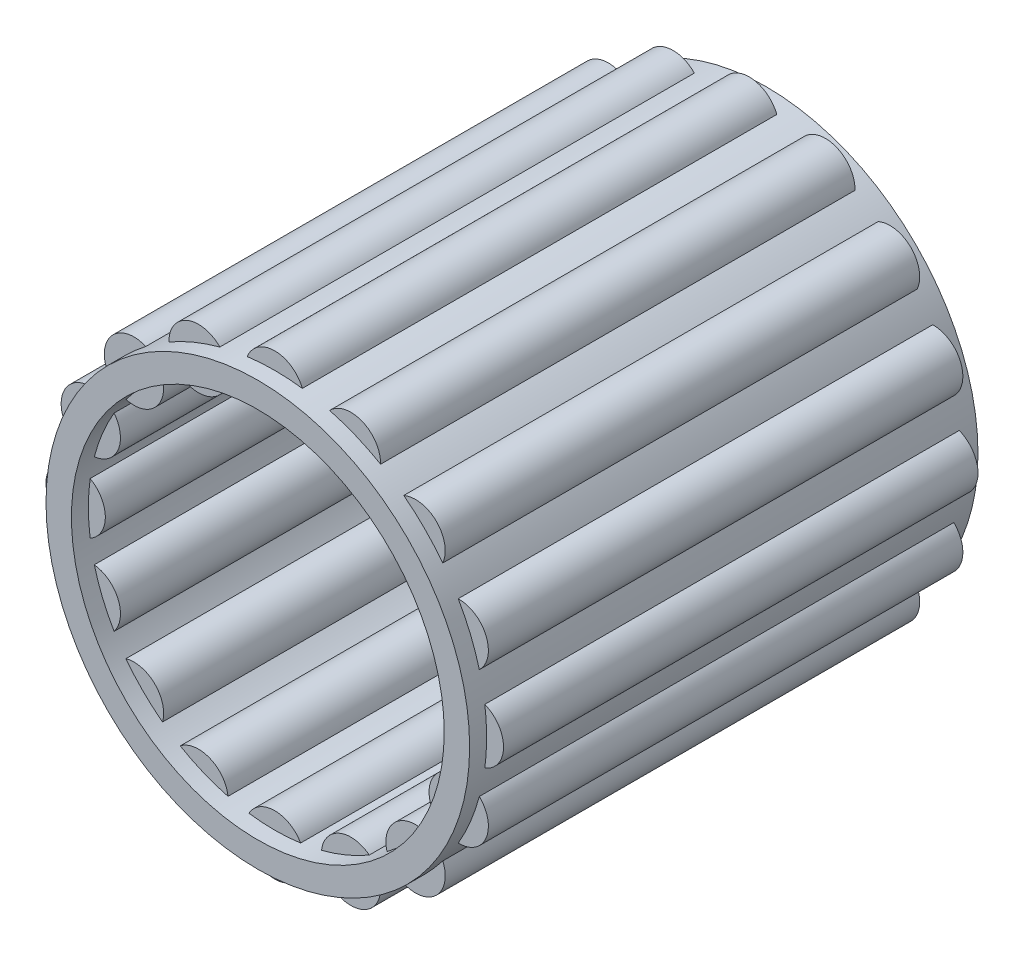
ISO-10303-21;
HEADER;
FILE_DESCRIPTION(('STEP AP214'),'2;1');
FILE_NAME('part.step','',(''),(''),'','','');
FILE_SCHEMA(('AUTOMOTIVE_DESIGN { 1 0 10303 214 1 1 1 1 }'));
ENDSEC;
DATA;
#1=APPLICATION_CONTEXT('core data for automotive mechanical design processes');
#2=APPLICATION_PROTOCOL_DEFINITION('international standard','automotive_design',2000,#1);
#3=PRODUCT_CONTEXT('',#1,'mechanical');
#4=PRODUCT('Part','Part','',(#3));
#5=PRODUCT_RELATED_PRODUCT_CATEGORY('part','',(#4));
#6=PRODUCT_DEFINITION_FORMATION('','',#4);
#7=PRODUCT_DEFINITION_CONTEXT('part definition',#1,'design');
#8=PRODUCT_DEFINITION('design','',#6,#7);
#9=PRODUCT_DEFINITION_SHAPE('','',#8);
#10=(LENGTH_UNIT() NAMED_UNIT(*) SI_UNIT(.MILLI.,.METRE.));
#11=(NAMED_UNIT(*) PLANE_ANGLE_UNIT() SI_UNIT($,.RADIAN.));
#12=(NAMED_UNIT(*) SI_UNIT($,.STERADIAN.) SOLID_ANGLE_UNIT());
#13=UNCERTAINTY_MEASURE_WITH_UNIT(LENGTH_MEASURE(1.E-05),#10,'distance_accuracy_value','');
#14=(GEOMETRIC_REPRESENTATION_CONTEXT(3) GLOBAL_UNCERTAINTY_ASSIGNED_CONTEXT((#13)) GLOBAL_UNIT_ASSIGNED_CONTEXT((#10,
#11,#12)) REPRESENTATION_CONTEXT('',''));
#15=CARTESIAN_POINT('',(0.,0.,0.));
#16=DIRECTION('',(0.,0.,1.));
#17=DIRECTION('',(1.,0.,0.));
#18=AXIS2_PLACEMENT_3D('',#15,#16,#17);
#19=CARTESIAN_POINT('',(0.,11.75,28.));
#20=DIRECTION('',(0.,0.,-1.));
#21=DIRECTION('',(-1.,0.,0.));
#22=AXIS2_PLACEMENT_3D('',#19,#20,#21);
#23=CYLINDRICAL_SURFACE('',#22,1.75);
#24=DIRECTION('',(0.,0.,-1.));
#25=VECTOR('',#24,1.);
#26=CARTESIAN_POINT('',(-1.62734665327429,12.3936170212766,14.));
#27=LINE('',#26,#25);
#28=CARTESIAN_POINT('',(-1.62734665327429,12.3936170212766,28.));
#29=VERTEX_POINT('',#28);
#30=CARTESIAN_POINT('',(-1.62734665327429,12.3936170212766,0.));
#31=VERTEX_POINT('',#30);
#32=EDGE_CURVE('E734',#29,#31,#27,.T.);
#33=ORIENTED_EDGE('',*,*,#32,.F.);
#34=CARTESIAN_POINT('',(0.,11.75,28.));
#35=DIRECTION('',(0.,0.,1.));
#36=DIRECTION('',(1.,0.,0.));
#37=AXIS2_PLACEMENT_3D('',#34,#35,#36);
#38=CIRCLE('',#37,1.75);
#39=CARTESIAN_POINT('',(1.62734665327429,12.3936170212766,28.));
#40=VERTEX_POINT('',#39);
#41=EDGE_CURVE('E744',#40,#29,#38,.T.);
#42=ORIENTED_EDGE('',*,*,#41,.F.);
#43=DIRECTION('',(0.,0.,-1.));
#44=VECTOR('',#43,1.);
#45=CARTESIAN_POINT('',(1.62734665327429,12.3936170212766,14.));
#46=LINE('',#45,#44);
#47=CARTESIAN_POINT('',(1.62734665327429,12.3936170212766,0.));
#48=VERTEX_POINT('',#47);
#49=EDGE_CURVE('E731',#48,#40,#46,.F.);
#50=ORIENTED_EDGE('',*,*,#49,.F.);
#51=CARTESIAN_POINT('',(0.,11.75,0.));
#52=DIRECTION('',(0.,0.,1.));
#53=DIRECTION('',(1.,0.,0.));
#54=AXIS2_PLACEMENT_3D('',#51,#52,#53);
#55=CIRCLE('',#54,1.75);
#56=EDGE_CURVE('E740',#48,#31,#55,.T.);
#57=ORIENTED_EDGE('',*,*,#56,.T.);
#58=EDGE_LOOP('',(#33,#42,#50,#57));
#59=FACE_BOUND('',#58,.T.);
#60=ADVANCED_FACE('F24',(#59),#23,.T.);
#61=CARTESIAN_POINT('',(0.,11.75,28.));
#62=DIRECTION('',(0.,0.,1.));
#63=DIRECTION('',(1.,0.,0.));
#64=AXIS2_PLACEMENT_3D('',#61,#62,#63);
#65=PLANE('',#64);
#66=ORIENTED_EDGE('',*,*,#41,.T.);
#67=CARTESIAN_POINT('',(0.,0.,28.));
#68=DIRECTION('',(0.,0.,1.));
#69=DIRECTION('',(1.,0.,0.));
#70=AXIS2_PLACEMENT_3D('',#67,#68,#69);
#71=CIRCLE('',#70,12.5);
#72=EDGE_CURVE('E737',#29,#40,#71,.F.);
#73=ORIENTED_EDGE('',*,*,#72,.T.);
#74=EDGE_LOOP('',(#66,#73));
#75=FACE_BOUND('',#74,.T.);
#76=ADVANCED_FACE('F938',(#75),#65,.T.);
#77=CARTESIAN_POINT('',(0.,11.75,0.));
#78=DIRECTION('',(0.,0.,1.));
#79=DIRECTION('',(1.,0.,0.));
#80=AXIS2_PLACEMENT_3D('',#77,#78,#79);
#81=PLANE('',#80);
#82=CARTESIAN_POINT('',(0.,0.,0.));
#83=DIRECTION('',(0.,0.,1.));
#84=DIRECTION('',(1.,0.,0.));
#85=AXIS2_PLACEMENT_3D('',#82,#83,#84);
#86=CIRCLE('',#85,12.5);
#87=EDGE_CURVE('E750',#31,#48,#86,.F.);
#88=ORIENTED_EDGE('',*,*,#87,.F.);
#89=ORIENTED_EDGE('',*,*,#56,.F.);
#90=EDGE_LOOP('',(#88,#89));
#91=FACE_BOUND('',#90,.T.);
#92=ADVANCED_FACE('F943',(#91),#81,.F.);
#93=CARTESIAN_POINT('',(0.,0.,29.));
#94=DIRECTION('',(0.,0.,1.));
#95=DIRECTION('',(1.,0.,0.));
#96=AXIS2_PLACEMENT_3D('',#93,#94,#95);
#97=PLANE('',#96);
#98=CARTESIAN_POINT('',(0.,0.,29.));
#99=DIRECTION('',(0.,0.,1.));
#100=DIRECTION('',(1.,0.,0.));
#101=AXIS2_PLACEMENT_3D('',#98,#99,#100);
#102=CIRCLE('',#101,12.5);
#103=CARTESIAN_POINT('',(12.5,0.,29.));
#104=VERTEX_POINT('',#103);
#105=EDGE_CURVE('E720',#104,#104,#102,.T.);
#106=ORIENTED_EDGE('',*,*,#105,.T.);
#107=EDGE_LOOP('',(#106));
#108=FACE_BOUND('',#107,.T.);
#109=CARTESIAN_POINT('',(0.,0.,29.));
#110=DIRECTION('',(0.,0.,1.));
#111=DIRECTION('',(1.,0.,0.));
#112=AXIS2_PLACEMENT_3D('',#109,#110,#111);
#113=CIRCLE('',#112,11.);
#114=CARTESIAN_POINT('',(11.,0.,29.));
#115=VERTEX_POINT('',#114);
#116=EDGE_CURVE('E714',#115,#115,#113,.T.);
#117=ORIENTED_EDGE('',*,*,#116,.F.);
#118=EDGE_LOOP('',(#117));
#119=FACE_BOUND('',#118,.T.);
#120=ADVANCED_FACE('F975',(#108,#119),#97,.T.);
#121=CARTESIAN_POINT('',(0.,0.,-1.));
#122=DIRECTION('',(0.,0.,1.));
#123=DIRECTION('',(1.,0.,0.));
#124=AXIS2_PLACEMENT_3D('',#121,#122,#123);
#125=PLANE('',#124);
#126=CARTESIAN_POINT('',(0.,0.,-1.));
#127=DIRECTION('',(0.,0.,1.));
#128=DIRECTION('',(1.,0.,0.));
#129=AXIS2_PLACEMENT_3D('',#126,#127,#128);
#130=CIRCLE('',#129,12.5);
#131=CARTESIAN_POINT('',(12.5,0.,-1.));
#132=VERTEX_POINT('',#131);
#133=EDGE_CURVE('E717',#132,#132,#130,.T.);
#134=ORIENTED_EDGE('',*,*,#133,.F.);
#135=EDGE_LOOP('',(#134));
#136=FACE_BOUND('',#135,.T.);
#137=CARTESIAN_POINT('',(0.,0.,-1.));
#138=DIRECTION('',(0.,0.,1.));
#139=DIRECTION('',(1.,0.,0.));
#140=AXIS2_PLACEMENT_3D('',#137,#138,#139);
#141=CIRCLE('',#140,11.);
#142=CARTESIAN_POINT('',(11.,0.,-1.));
#143=VERTEX_POINT('',#142);
#144=EDGE_CURVE('E711',#143,#143,#141,.T.);
#145=ORIENTED_EDGE('',*,*,#144,.T.);
#146=EDGE_LOOP('',(#145));
#147=FACE_BOUND('',#146,.T.);
#148=ADVANCED_FACE('F980',(#136,#147),#125,.F.);
#149=CARTESIAN_POINT('',(0.,0.,29.));
#150=DIRECTION('',(0.,0.,-1.));
#151=DIRECTION('',(-1.,0.,0.));
#152=AXIS2_PLACEMENT_3D('',#149,#150,#151);
#153=CYLINDRICAL_SURFACE('',#152,12.5);
#154=DIRECTION('',(0.,0.,-1.));
#155=VECTOR('',#154,1.);
#156=CARTESIAN_POINT('',(-3.23935963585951,12.0729677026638,14.));
#157=LINE('',#156,#155);
#158=CARTESIAN_POINT('',(-3.23935963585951,12.0729677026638,28.));
#159=VERTEX_POINT('',#158);
#160=CARTESIAN_POINT('',(-3.2393596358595,12.0729677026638,0.));
#161=VERTEX_POINT('',#160);
#162=EDGE_CURVE('E39',#159,#161,#157,.T.);
#163=ORIENTED_EDGE('',*,*,#162,.F.);
#164=CARTESIAN_POINT('',(0.,0.,28.));
#165=DIRECTION('',(0.,0.,1.));
#166=DIRECTION('',(1.,0.,0.));
#167=AXIS2_PLACEMENT_3D('',#164,#165,#166);
#168=CIRCLE('',#167,12.5);
#169=CARTESIAN_POINT('',(-6.24630416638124,10.8274504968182,28.));
#170=VERTEX_POINT('',#169);
#171=EDGE_CURVE('E43',#159,#170,#168,.T.);
#172=ORIENTED_EDGE('',*,*,#171,.T.);
#173=DIRECTION('',(0.,0.,-1.));
#174=VECTOR('',#173,1.);
#175=CARTESIAN_POINT('',(-6.24630416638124,10.8274504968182,14.));
#176=LINE('',#175,#174);
#177=CARTESIAN_POINT('',(-6.24630416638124,10.8274504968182,0.));
#178=VERTEX_POINT('',#177);
#179=EDGE_CURVE('E419',#178,#170,#176,.F.);
#180=ORIENTED_EDGE('',*,*,#179,.F.);
#181=CARTESIAN_POINT('',(0.,0.,0.));
#182=DIRECTION('',(0.,0.,1.));
#183=DIRECTION('',(1.,0.,0.));
#184=AXIS2_PLACEMENT_3D('',#181,#182,#183);
#185=CIRCLE('',#184,12.5);
#186=EDGE_CURVE('E423',#161,#178,#185,.T.);
#187=ORIENTED_EDGE('',*,*,#186,.F.);
#188=EDGE_LOOP('',(#163,#172,#180,#187));
#189=FACE_BOUND('',#188,.T.);
#190=DIRECTION('',(0.,0.,-1.));
#191=VECTOR('',#190,1.);
#192=CARTESIAN_POINT('',(-7.6129027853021,9.91431849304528,14.));
#193=LINE('',#192,#191);
#194=CARTESIAN_POINT('',(-7.6129027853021,9.91431849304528,28.));
#195=VERTEX_POINT('',#194);
#196=CARTESIAN_POINT('',(-7.6129027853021,9.91431849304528,0.));
#197=VERTEX_POINT('',#196);
#198=EDGE_CURVE('E461',#195,#197,#193,.T.);
#199=ORIENTED_EDGE('',*,*,#198,.F.);
#200=CARTESIAN_POINT('',(0.,0.,28.));
#201=DIRECTION('',(0.,0.,1.));
#202=DIRECTION('',(1.,0.,0.));
#203=AXIS2_PLACEMENT_3D('',#200,#201,#202);
#204=CIRCLE('',#203,12.5);
#205=CARTESIAN_POINT('',(-9.91431849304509,7.61290278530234,28.));
#206=VERTEX_POINT('',#205);
#207=EDGE_CURVE('E456',#195,#206,#204,.T.);
#208=ORIENTED_EDGE('',*,*,#207,.T.);
#209=DIRECTION('',(0.,0.,-1.));
#210=VECTOR('',#209,1.);
#211=CARTESIAN_POINT('',(-9.91431849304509,7.61290278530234,14.));
#212=LINE('',#211,#210);
#213=CARTESIAN_POINT('',(-9.91431849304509,7.61290278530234,0.));
#214=VERTEX_POINT('',#213);
#215=EDGE_CURVE('E458',#214,#206,#212,.F.);
#216=ORIENTED_EDGE('',*,*,#215,.F.);
#217=CARTESIAN_POINT('',(0.,0.,0.));
#218=DIRECTION('',(0.,0.,1.));
#219=DIRECTION('',(1.,0.,0.));
#220=AXIS2_PLACEMENT_3D('',#217,#218,#219);
#221=CIRCLE('',#220,12.5);
#222=EDGE_CURVE('E453',#197,#214,#221,.T.);
#223=ORIENTED_EDGE('',*,*,#222,.F.);
#224=EDGE_LOOP('',(#199,#208,#216,#223));
#225=FACE_BOUND('',#224,.T.);
#226=DIRECTION('',(0.,0.,-1.));
#227=VECTOR('',#226,1.);
#228=CARTESIAN_POINT('',(-10.827450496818,6.24630416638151,14.));
#229=LINE('',#228,#227);
#230=CARTESIAN_POINT('',(-10.827450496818,6.24630416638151,28.));
#231=VERTEX_POINT('',#230);
#232=CARTESIAN_POINT('',(-10.827450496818,6.24630416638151,0.));
#233=VERTEX_POINT('',#232);
#234=EDGE_CURVE('E480',#231,#233,#229,.T.);
#235=ORIENTED_EDGE('',*,*,#234,.F.);
#236=CARTESIAN_POINT('',(0.,0.,28.));
#237=DIRECTION('',(0.,0.,1.));
#238=DIRECTION('',(1.,0.,0.));
#239=AXIS2_PLACEMENT_3D('',#236,#237,#238);
#240=CIRCLE('',#239,12.5);
#241=CARTESIAN_POINT('',(-12.0729677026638,3.2393596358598,28.));
#242=VERTEX_POINT('',#241);
#243=EDGE_CURVE('E475',#231,#242,#240,.T.);
#244=ORIENTED_EDGE('',*,*,#243,.T.);
#245=DIRECTION('',(0.,0.,-1.));
#246=VECTOR('',#245,1.);
#247=CARTESIAN_POINT('',(-12.0729677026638,3.2393596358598,14.));
#248=LINE('',#247,#246);
#249=CARTESIAN_POINT('',(-12.0729677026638,3.2393596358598,0.));
#250=VERTEX_POINT('',#249);
#251=EDGE_CURVE('E477',#250,#242,#248,.F.);
#252=ORIENTED_EDGE('',*,*,#251,.F.);
#253=CARTESIAN_POINT('',(0.,0.,0.));
#254=DIRECTION('',(0.,0.,1.));
#255=DIRECTION('',(1.,0.,0.));
#256=AXIS2_PLACEMENT_3D('',#253,#254,#255);
#257=CIRCLE('',#256,12.5);
#258=EDGE_CURVE('E472',#233,#250,#257,.T.);
#259=ORIENTED_EDGE('',*,*,#258,.F.);
#260=EDGE_LOOP('',(#235,#244,#252,#259));
#261=FACE_BOUND('',#260,.T.);
#262=DIRECTION('',(0.,0.,-1.));
#263=VECTOR('',#262,1.);
#264=CARTESIAN_POINT('',(-12.3936170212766,1.62734665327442,14.));
#265=LINE('',#264,#263);
#266=CARTESIAN_POINT('',(-12.3936170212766,1.62734665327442,28.));
#267=VERTEX_POINT('',#266);
#268=CARTESIAN_POINT('',(-12.3936170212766,1.62734665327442,0.));
#269=VERTEX_POINT('',#268);
#270=EDGE_CURVE('E499',#267,#269,#265,.T.);
#271=ORIENTED_EDGE('',*,*,#270,.F.);
#272=CARTESIAN_POINT('',(0.,0.,28.));
#273=DIRECTION('',(0.,0.,1.));
#274=DIRECTION('',(1.,0.,0.));
#275=AXIS2_PLACEMENT_3D('',#272,#273,#274);
#276=CIRCLE('',#275,12.5);
#277=CARTESIAN_POINT('',(-12.3936170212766,-1.62734665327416,28.));
#278=VERTEX_POINT('',#277);
#279=EDGE_CURVE('E494',#267,#278,#276,.T.);
#280=ORIENTED_EDGE('',*,*,#279,.T.);
#281=DIRECTION('',(0.,0.,-1.));
#282=VECTOR('',#281,1.);
#283=CARTESIAN_POINT('',(-12.3936170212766,-1.62734665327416,14.));
#284=LINE('',#283,#282);
#285=CARTESIAN_POINT('',(-12.3936170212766,-1.62734665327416,0.));
#286=VERTEX_POINT('',#285);
#287=EDGE_CURVE('E496',#286,#278,#284,.F.);
#288=ORIENTED_EDGE('',*,*,#287,.F.);
#289=CARTESIAN_POINT('',(0.,0.,0.));
#290=DIRECTION('',(0.,0.,1.));
#291=DIRECTION('',(1.,0.,0.));
#292=AXIS2_PLACEMENT_3D('',#289,#290,#291);
#293=CIRCLE('',#292,12.5);
#294=EDGE_CURVE('E491',#269,#286,#293,.T.);
#295=ORIENTED_EDGE('',*,*,#294,.F.);
#296=EDGE_LOOP('',(#271,#280,#288,#295));
#297=FACE_BOUND('',#296,.T.);
#298=DIRECTION('',(0.,0.,-1.));
#299=VECTOR('',#298,1.);
#300=CARTESIAN_POINT('',(-12.0729677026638,-3.23935963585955,14.));
#301=LINE('',#300,#299);
#302=CARTESIAN_POINT('',(-12.0729677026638,-3.23935963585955,28.));
#303=VERTEX_POINT('',#302);
#304=CARTESIAN_POINT('',(-12.0729677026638,-3.23935963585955,0.));
#305=VERTEX_POINT('',#304);
#306=EDGE_CURVE('E518',#303,#305,#301,.T.);
#307=ORIENTED_EDGE('',*,*,#306,.F.);
#308=CARTESIAN_POINT('',(0.,0.,28.));
#309=DIRECTION('',(0.,0.,1.));
#310=DIRECTION('',(1.,0.,0.));
#311=AXIS2_PLACEMENT_3D('',#308,#309,#310);
#312=CIRCLE('',#311,12.5);
#313=CARTESIAN_POINT('',(-10.8274504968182,-6.24630416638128,28.));
#314=VERTEX_POINT('',#313);
#315=EDGE_CURVE('E513',#303,#314,#312,.T.);
#316=ORIENTED_EDGE('',*,*,#315,.T.);
#317=DIRECTION('',(0.,0.,-1.));
#318=VECTOR('',#317,1.);
#319=CARTESIAN_POINT('',(-10.8274504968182,-6.24630416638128,14.));
#320=LINE('',#319,#318);
#321=CARTESIAN_POINT('',(-10.8274504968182,-6.24630416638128,0.));
#322=VERTEX_POINT('',#321);
#323=EDGE_CURVE('E515',#322,#314,#320,.F.);
#324=ORIENTED_EDGE('',*,*,#323,.F.);
#325=CARTESIAN_POINT('',(0.,0.,0.));
#326=DIRECTION('',(0.,0.,1.));
#327=DIRECTION('',(1.,0.,0.));
#328=AXIS2_PLACEMENT_3D('',#325,#326,#327);
#329=CIRCLE('',#328,12.5);
#330=EDGE_CURVE('E510',#305,#322,#329,.T.);
#331=ORIENTED_EDGE('',*,*,#330,.F.);
#332=EDGE_LOOP('',(#307,#316,#324,#331));
#333=FACE_BOUND('',#332,.T.);
#334=DIRECTION('',(0.,0.,-1.));
#335=VECTOR('',#334,1.);
#336=CARTESIAN_POINT('',(-9.91431849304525,-7.61290278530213,14.));
#337=LINE('',#336,#335);
#338=CARTESIAN_POINT('',(-9.91431849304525,-7.61290278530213,28.));
#339=VERTEX_POINT('',#338);
#340=CARTESIAN_POINT('',(-9.91431849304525,-7.61290278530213,0.));
#341=VERTEX_POINT('',#340);
#342=EDGE_CURVE('E537',#339,#341,#337,.T.);
#343=ORIENTED_EDGE('',*,*,#342,.F.);
#344=CARTESIAN_POINT('',(0.,0.,28.));
#345=DIRECTION('',(0.,0.,1.));
#346=DIRECTION('',(1.,0.,0.));
#347=AXIS2_PLACEMENT_3D('',#344,#345,#346);
#348=CIRCLE('',#347,12.5);
#349=CARTESIAN_POINT('',(-7.6129027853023,-9.91431849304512,28.));
#350=VERTEX_POINT('',#349);
#351=EDGE_CURVE('E532',#339,#350,#348,.T.);
#352=ORIENTED_EDGE('',*,*,#351,.T.);
#353=DIRECTION('',(0.,0.,-1.));
#354=VECTOR('',#353,1.);
#355=CARTESIAN_POINT('',(-7.6129027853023,-9.91431849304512,14.));
#356=LINE('',#355,#354);
#357=CARTESIAN_POINT('',(-7.6129027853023,-9.91431849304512,0.));
#358=VERTEX_POINT('',#357);
#359=EDGE_CURVE('E534',#358,#350,#356,.F.);
#360=ORIENTED_EDGE('',*,*,#359,.F.);
#361=CARTESIAN_POINT('',(0.,0.,0.));
#362=DIRECTION('',(0.,0.,1.));
#363=DIRECTION('',(1.,0.,0.));
#364=AXIS2_PLACEMENT_3D('',#361,#362,#363);
#365=CIRCLE('',#364,12.5);
#366=EDGE_CURVE('E529',#341,#358,#365,.T.);
#367=ORIENTED_EDGE('',*,*,#366,.F.);
#368=EDGE_LOOP('',(#343,#352,#360,#367));
#369=FACE_BOUND('',#368,.T.);
#370=DIRECTION('',(0.,0.,-1.));
#371=VECTOR('',#370,1.);
#372=CARTESIAN_POINT('',(-6.24630416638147,-10.8274504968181,14.));
#373=LINE('',#372,#371);
#374=CARTESIAN_POINT('',(-6.24630416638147,-10.8274504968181,28.));
#375=VERTEX_POINT('',#374);
#376=CARTESIAN_POINT('',(-6.24630416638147,-10.8274504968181,0.));
#377=VERTEX_POINT('',#376);
#378=EDGE_CURVE('E556',#375,#377,#373,.T.);
#379=ORIENTED_EDGE('',*,*,#378,.F.);
#380=CARTESIAN_POINT('',(0.,0.,28.));
#381=DIRECTION('',(0.,0.,1.));
#382=DIRECTION('',(1.,0.,0.));
#383=AXIS2_PLACEMENT_3D('',#380,#381,#382);
#384=CIRCLE('',#383,12.5);
#385=CARTESIAN_POINT('',(-3.23935963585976,-12.0729677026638,28.));
#386=VERTEX_POINT('',#385);
#387=EDGE_CURVE('E551',#375,#386,#384,.T.);
#388=ORIENTED_EDGE('',*,*,#387,.T.);
#389=DIRECTION('',(0.,0.,-1.));
#390=VECTOR('',#389,1.);
#391=CARTESIAN_POINT('',(-3.23935963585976,-12.0729677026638,14.));
#392=LINE('',#391,#390);
#393=CARTESIAN_POINT('',(-3.23935963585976,-12.0729677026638,0.));
#394=VERTEX_POINT('',#393);
#395=EDGE_CURVE('E553',#394,#386,#392,.F.);
#396=ORIENTED_EDGE('',*,*,#395,.F.);
#397=CARTESIAN_POINT('',(0.,0.,0.));
#398=DIRECTION('',(0.,0.,1.));
#399=DIRECTION('',(1.,0.,0.));
#400=AXIS2_PLACEMENT_3D('',#397,#398,#399);
#401=CIRCLE('',#400,12.5);
#402=EDGE_CURVE('E548',#377,#394,#401,.T.);
#403=ORIENTED_EDGE('',*,*,#402,.F.);
#404=EDGE_LOOP('',(#379,#388,#396,#403));
#405=FACE_BOUND('',#404,.T.);
#406=DIRECTION('',(0.,0.,-1.));
#407=VECTOR('',#406,1.);
#408=CARTESIAN_POINT('',(-1.62734665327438,-12.3936170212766,14.));
#409=LINE('',#408,#407);
#410=CARTESIAN_POINT('',(-1.62734665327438,-12.3936170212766,28.));
#411=VERTEX_POINT('',#410);
#412=CARTESIAN_POINT('',(-1.62734665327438,-12.3936170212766,0.));
#413=VERTEX_POINT('',#412);
#414=EDGE_CURVE('E575',#411,#413,#409,.T.);
#415=ORIENTED_EDGE('',*,*,#414,.F.);
#416=CARTESIAN_POINT('',(0.,0.,28.));
#417=DIRECTION('',(0.,0.,1.));
#418=DIRECTION('',(1.,0.,0.));
#419=AXIS2_PLACEMENT_3D('',#416,#417,#418);
#420=CIRCLE('',#419,12.5);
#421=CARTESIAN_POINT('',(1.6273466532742,-12.3936170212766,28.));
#422=VERTEX_POINT('',#421);
#423=EDGE_CURVE('E570',#411,#422,#420,.T.);
#424=ORIENTED_EDGE('',*,*,#423,.T.);
#425=DIRECTION('',(0.,0.,-1.));
#426=VECTOR('',#425,1.);
#427=CARTESIAN_POINT('',(1.6273466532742,-12.3936170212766,14.));
#428=LINE('',#427,#426);
#429=CARTESIAN_POINT('',(1.6273466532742,-12.3936170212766,0.));
#430=VERTEX_POINT('',#429);
#431=EDGE_CURVE('E572',#430,#422,#428,.F.);
#432=ORIENTED_EDGE('',*,*,#431,.F.);
#433=CARTESIAN_POINT('',(0.,0.,0.));
#434=DIRECTION('',(0.,0.,1.));
#435=DIRECTION('',(1.,0.,0.));
#436=AXIS2_PLACEMENT_3D('',#433,#434,#435);
#437=CIRCLE('',#436,12.5);
#438=EDGE_CURVE('E567',#413,#430,#437,.T.);
#439=ORIENTED_EDGE('',*,*,#438,.F.);
#440=EDGE_LOOP('',(#415,#424,#432,#439));
#441=FACE_BOUND('',#440,.T.);
#442=DIRECTION('',(0.,0.,-1.));
#443=VECTOR('',#442,1.);
#444=CARTESIAN_POINT('',(3.23935963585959,-12.0729677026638,14.));
#445=LINE('',#444,#443);
#446=CARTESIAN_POINT('',(3.23935963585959,-12.0729677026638,28.));
#447=VERTEX_POINT('',#446);
#448=CARTESIAN_POINT('',(3.23935963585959,-12.0729677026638,0.));
#449=VERTEX_POINT('',#448);
#450=EDGE_CURVE('E594',#447,#449,#445,.T.);
#451=ORIENTED_EDGE('',*,*,#450,.F.);
#452=CARTESIAN_POINT('',(0.,0.,28.));
#453=DIRECTION('',(0.,0.,1.));
#454=DIRECTION('',(1.,0.,0.));
#455=AXIS2_PLACEMENT_3D('',#452,#453,#454);
#456=CIRCLE('',#455,12.5);
#457=CARTESIAN_POINT('',(6.24630416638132,-10.8274504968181,28.));
#458=VERTEX_POINT('',#457);
#459=EDGE_CURVE('E589',#447,#458,#456,.T.);
#460=ORIENTED_EDGE('',*,*,#459,.T.);
#461=DIRECTION('',(0.,0.,-1.));
#462=VECTOR('',#461,1.);
#463=CARTESIAN_POINT('',(6.24630416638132,-10.8274504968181,14.));
#464=LINE('',#463,#462);
#465=CARTESIAN_POINT('',(6.24630416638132,-10.8274504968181,0.));
#466=VERTEX_POINT('',#465);
#467=EDGE_CURVE('E591',#466,#458,#464,.F.);
#468=ORIENTED_EDGE('',*,*,#467,.F.);
#469=CARTESIAN_POINT('',(0.,0.,0.));
#470=DIRECTION('',(0.,0.,1.));
#471=DIRECTION('',(1.,0.,0.));
#472=AXIS2_PLACEMENT_3D('',#469,#470,#471);
#473=CIRCLE('',#472,12.5);
#474=EDGE_CURVE('E586',#449,#466,#473,.T.);
#475=ORIENTED_EDGE('',*,*,#474,.F.);
#476=EDGE_LOOP('',(#451,#460,#468,#475));
#477=FACE_BOUND('',#476,.T.);
#478=DIRECTION('',(0.,0.,-1.));
#479=VECTOR('',#478,1.);
#480=CARTESIAN_POINT('',(7.61290278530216,-9.91431849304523,14.));
#481=LINE('',#480,#479);
#482=CARTESIAN_POINT('',(7.61290278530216,-9.91431849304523,28.));
#483=VERTEX_POINT('',#482);
#484=CARTESIAN_POINT('',(7.61290278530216,-9.91431849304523,0.));
#485=VERTEX_POINT('',#484);
#486=EDGE_CURVE('E613',#483,#485,#481,.T.);
#487=ORIENTED_EDGE('',*,*,#486,.F.);
#488=CARTESIAN_POINT('',(0.,0.,28.));
#489=DIRECTION('',(0.,0.,1.));
#490=DIRECTION('',(1.,0.,0.));
#491=AXIS2_PLACEMENT_3D('',#488,#489,#490);
#492=CIRCLE('',#491,12.5);
#493=CARTESIAN_POINT('',(9.91431849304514,-7.61290278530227,28.));
#494=VERTEX_POINT('',#493);
#495=EDGE_CURVE('E608',#483,#494,#492,.T.);
#496=ORIENTED_EDGE('',*,*,#495,.T.);
#497=DIRECTION('',(0.,0.,-1.));
#498=VECTOR('',#497,1.);
#499=CARTESIAN_POINT('',(9.91431849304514,-7.61290278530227,14.));
#500=LINE('',#499,#498);
#501=CARTESIAN_POINT('',(9.91431849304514,-7.61290278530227,0.));
#502=VERTEX_POINT('',#501);
#503=EDGE_CURVE('E610',#502,#494,#500,.F.);
#504=ORIENTED_EDGE('',*,*,#503,.F.);
#505=CARTESIAN_POINT('',(0.,0.,0.));
#506=DIRECTION('',(0.,0.,1.));
#507=DIRECTION('',(1.,0.,0.));
#508=AXIS2_PLACEMENT_3D('',#505,#506,#507);
#509=CIRCLE('',#508,12.5);
#510=EDGE_CURVE('E605',#485,#502,#509,.T.);
#511=ORIENTED_EDGE('',*,*,#510,.F.);
#512=EDGE_LOOP('',(#487,#496,#504,#511));
#513=FACE_BOUND('',#512,.T.);
#514=DIRECTION('',(0.,0.,-1.));
#515=VECTOR('',#514,1.);
#516=CARTESIAN_POINT('',(10.8274504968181,-6.24630416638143,14.));
#517=LINE('',#516,#515);
#518=CARTESIAN_POINT('',(10.8274504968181,-6.24630416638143,28.));
#519=VERTEX_POINT('',#518);
#520=CARTESIAN_POINT('',(10.8274504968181,-6.24630416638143,0.));
#521=VERTEX_POINT('',#520);
#522=EDGE_CURVE('E632',#519,#521,#517,.T.);
#523=ORIENTED_EDGE('',*,*,#522,.F.);
#524=CARTESIAN_POINT('',(0.,0.,28.));
#525=DIRECTION('',(0.,0.,1.));
#526=DIRECTION('',(1.,0.,0.));
#527=AXIS2_PLACEMENT_3D('',#524,#525,#526);
#528=CIRCLE('',#527,12.5);
#529=CARTESIAN_POINT('',(12.0729677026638,-3.23935963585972,28.));
#530=VERTEX_POINT('',#529);
#531=EDGE_CURVE('E627',#519,#530,#528,.T.);
#532=ORIENTED_EDGE('',*,*,#531,.T.);
#533=DIRECTION('',(0.,0.,-1.));
#534=VECTOR('',#533,1.);
#535=CARTESIAN_POINT('',(12.0729677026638,-3.23935963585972,14.));
#536=LINE('',#535,#534);
#537=CARTESIAN_POINT('',(12.0729677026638,-3.23935963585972,0.));
#538=VERTEX_POINT('',#537);
#539=EDGE_CURVE('E629',#538,#530,#536,.F.);
#540=ORIENTED_EDGE('',*,*,#539,.F.);
#541=CARTESIAN_POINT('',(0.,0.,0.));
#542=DIRECTION('',(0.,0.,1.));
#543=DIRECTION('',(1.,0.,0.));
#544=AXIS2_PLACEMENT_3D('',#541,#542,#543);
#545=CIRCLE('',#544,12.5);
#546=EDGE_CURVE('E624',#521,#538,#545,.T.);
#547=ORIENTED_EDGE('',*,*,#546,.F.);
#548=EDGE_LOOP('',(#523,#532,#540,#547));
#549=FACE_BOUND('',#548,.T.);
#550=DIRECTION('',(0.,0.,-1.));
#551=VECTOR('',#550,1.);
#552=CARTESIAN_POINT('',(12.3936170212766,-1.62734665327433,14.));
#553=LINE('',#552,#551);
#554=CARTESIAN_POINT('',(12.3936170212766,-1.62734665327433,28.));
#555=VERTEX_POINT('',#554);
#556=CARTESIAN_POINT('',(12.3936170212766,-1.62734665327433,0.));
#557=VERTEX_POINT('',#556);
#558=EDGE_CURVE('E651',#555,#557,#553,.T.);
#559=ORIENTED_EDGE('',*,*,#558,.F.);
#560=CARTESIAN_POINT('',(0.,0.,28.));
#561=DIRECTION('',(0.,0.,1.));
#562=DIRECTION('',(1.,0.,0.));
#563=AXIS2_PLACEMENT_3D('',#560,#561,#562);
#564=CIRCLE('',#563,12.5);
#565=CARTESIAN_POINT('',(12.3936170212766,1.62734665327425,28.));
#566=VERTEX_POINT('',#565);
#567=EDGE_CURVE('E646',#555,#566,#564,.T.);
#568=ORIENTED_EDGE('',*,*,#567,.T.);
#569=DIRECTION('',(0.,0.,-1.));
#570=VECTOR('',#569,1.);
#571=CARTESIAN_POINT('',(12.3936170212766,1.62734665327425,14.));
#572=LINE('',#571,#570);
#573=CARTESIAN_POINT('',(12.3936170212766,1.62734665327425,0.));
#574=VERTEX_POINT('',#573);
#575=EDGE_CURVE('E648',#574,#566,#572,.F.);
#576=ORIENTED_EDGE('',*,*,#575,.F.);
#577=CARTESIAN_POINT('',(0.,0.,0.));
#578=DIRECTION('',(0.,0.,1.));
#579=DIRECTION('',(1.,0.,0.));
#580=AXIS2_PLACEMENT_3D('',#577,#578,#579);
#581=CIRCLE('',#580,12.5);
#582=EDGE_CURVE('E643',#557,#574,#581,.T.);
#583=ORIENTED_EDGE('',*,*,#582,.F.);
#584=EDGE_LOOP('',(#559,#568,#576,#583));
#585=FACE_BOUND('',#584,.T.);
#586=DIRECTION('',(0.,0.,-1.));
#587=VECTOR('',#586,1.);
#588=CARTESIAN_POINT('',(12.0729677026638,3.23935963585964,14.));
#589=LINE('',#588,#587);
#590=CARTESIAN_POINT('',(12.0729677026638,3.23935963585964,28.));
#591=VERTEX_POINT('',#590);
#592=CARTESIAN_POINT('',(12.0729677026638,3.23935963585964,0.));
#593=VERTEX_POINT('',#592);
#594=EDGE_CURVE('E670',#591,#593,#589,.T.);
#595=ORIENTED_EDGE('',*,*,#594,.F.);
#596=CARTESIAN_POINT('',(0.,0.,28.));
#597=DIRECTION('',(0.,0.,1.));
#598=DIRECTION('',(1.,0.,0.));
#599=AXIS2_PLACEMENT_3D('',#596,#597,#598);
#600=CIRCLE('',#599,12.5);
#601=CARTESIAN_POINT('',(10.8274504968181,6.24630416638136,28.));
#602=VERTEX_POINT('',#601);
#603=EDGE_CURVE('E665',#591,#602,#600,.T.);
#604=ORIENTED_EDGE('',*,*,#603,.T.);
#605=DIRECTION('',(0.,0.,-1.));
#606=VECTOR('',#605,1.);
#607=CARTESIAN_POINT('',(10.8274504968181,6.24630416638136,14.));
#608=LINE('',#607,#606);
#609=CARTESIAN_POINT('',(10.8274504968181,6.24630416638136,0.));
#610=VERTEX_POINT('',#609);
#611=EDGE_CURVE('E667',#610,#602,#608,.F.);
#612=ORIENTED_EDGE('',*,*,#611,.F.);
#613=CARTESIAN_POINT('',(0.,0.,0.));
#614=DIRECTION('',(0.,0.,1.));
#615=DIRECTION('',(1.,0.,0.));
#616=AXIS2_PLACEMENT_3D('',#613,#614,#615);
#617=CIRCLE('',#616,12.5);
#618=EDGE_CURVE('E662',#593,#610,#617,.T.);
#619=ORIENTED_EDGE('',*,*,#618,.F.);
#620=EDGE_LOOP('',(#595,#604,#612,#619));
#621=FACE_BOUND('',#620,.T.);
#622=DIRECTION('',(0.,0.,-1.));
#623=VECTOR('',#622,1.);
#624=CARTESIAN_POINT('',(9.9143184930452,7.6129027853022,14.));
#625=LINE('',#624,#623);
#626=CARTESIAN_POINT('',(9.9143184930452,7.6129027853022,28.));
#627=VERTEX_POINT('',#626);
#628=CARTESIAN_POINT('',(9.9143184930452,7.6129027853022,0.));
#629=VERTEX_POINT('',#628);
#630=EDGE_CURVE('E689',#627,#629,#625,.T.);
#631=ORIENTED_EDGE('',*,*,#630,.F.);
#632=CARTESIAN_POINT('',(0.,0.,28.));
#633=DIRECTION('',(0.,0.,1.));
#634=DIRECTION('',(1.,0.,0.));
#635=AXIS2_PLACEMENT_3D('',#632,#633,#634);
#636=CIRCLE('',#635,12.5);
#637=CARTESIAN_POINT('',(7.61290278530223,9.91431849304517,28.));
#638=VERTEX_POINT('',#637);
#639=EDGE_CURVE('E684',#627,#638,#636,.T.);
#640=ORIENTED_EDGE('',*,*,#639,.T.);
#641=DIRECTION('',(0.,0.,-1.));
#642=VECTOR('',#641,1.);
#643=CARTESIAN_POINT('',(7.61290278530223,9.91431849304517,14.));
#644=LINE('',#643,#642);
#645=CARTESIAN_POINT('',(7.61290278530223,9.91431849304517,0.));
#646=VERTEX_POINT('',#645);
#647=EDGE_CURVE('E686',#646,#638,#644,.F.);
#648=ORIENTED_EDGE('',*,*,#647,.F.);
#649=CARTESIAN_POINT('',(0.,0.,0.));
#650=DIRECTION('',(0.,0.,1.));
#651=DIRECTION('',(1.,0.,0.));
#652=AXIS2_PLACEMENT_3D('',#649,#650,#651);
#653=CIRCLE('',#652,12.5);
#654=EDGE_CURVE('E681',#629,#646,#653,.T.);
#655=ORIENTED_EDGE('',*,*,#654,.F.);
#656=EDGE_LOOP('',(#631,#640,#648,#655));
#657=FACE_BOUND('',#656,.T.);
#658=DIRECTION('',(0.,0.,-1.));
#659=VECTOR('',#658,1.);
#660=CARTESIAN_POINT('',(6.2463041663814,10.8274504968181,14.));
#661=LINE('',#660,#659);
#662=CARTESIAN_POINT('',(6.2463041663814,10.8274504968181,28.));
#663=VERTEX_POINT('',#662);
#664=CARTESIAN_POINT('',(6.2463041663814,10.8274504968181,0.));
#665=VERTEX_POINT('',#664);
#666=EDGE_CURVE('E708',#663,#665,#661,.T.);
#667=ORIENTED_EDGE('',*,*,#666,.F.);
#668=CARTESIAN_POINT('',(0.,0.,28.));
#669=DIRECTION('',(0.,0.,1.));
#670=DIRECTION('',(1.,0.,0.));
#671=AXIS2_PLACEMENT_3D('',#668,#669,#670);
#672=CIRCLE('',#671,12.5);
#673=CARTESIAN_POINT('',(3.23935963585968,12.0729677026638,28.));
#674=VERTEX_POINT('',#673);
#675=EDGE_CURVE('E703',#663,#674,#672,.T.);
#676=ORIENTED_EDGE('',*,*,#675,.T.);
#677=DIRECTION('',(0.,0.,-1.));
#678=VECTOR('',#677,1.);
#679=CARTESIAN_POINT('',(3.23935963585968,12.0729677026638,14.));
#680=LINE('',#679,#678);
#681=CARTESIAN_POINT('',(3.23935963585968,12.0729677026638,0.));
#682=VERTEX_POINT('',#681);
#683=EDGE_CURVE('E705',#682,#674,#680,.F.);
#684=ORIENTED_EDGE('',*,*,#683,.F.);
#685=CARTESIAN_POINT('',(0.,0.,0.));
#686=DIRECTION('',(0.,0.,1.));
#687=DIRECTION('',(1.,0.,0.));
#688=AXIS2_PLACEMENT_3D('',#685,#686,#687);
#689=CIRCLE('',#688,12.5);
#690=EDGE_CURVE('E700',#665,#682,#689,.T.);
#691=ORIENTED_EDGE('',*,*,#690,.F.);
#692=EDGE_LOOP('',(#667,#676,#684,#691));
#693=FACE_BOUND('',#692,.T.);
#694=ORIENTED_EDGE('',*,*,#72,.F.);
#695=ORIENTED_EDGE('',*,*,#32,.T.);
#696=ORIENTED_EDGE('',*,*,#87,.T.);
#697=ORIENTED_EDGE('',*,*,#49,.T.);
#698=EDGE_LOOP('',(#694,#695,#696,#697));
#699=FACE_BOUND('',#698,.T.);
#700=ORIENTED_EDGE('',*,*,#105,.F.);
#701=EDGE_LOOP('',(#700));
#702=FACE_BOUND('',#701,.T.);
#703=ORIENTED_EDGE('',*,*,#133,.T.);
#704=EDGE_LOOP('',(#703));
#705=FACE_BOUND('',#704,.T.);
#706=ADVANCED_FACE('F421',(#189,#225,#261,#297,#333,#369,#405,#441,#477,#513,#549,#585,#621,
#657,#693,#699,#702,#705),#153,.T.);
#707=CARTESIAN_POINT('',(0.,0.,29.));
#708=DIRECTION('',(0.,0.,-1.));
#709=DIRECTION('',(-1.,0.,0.));
#710=AXIS2_PLACEMENT_3D('',#707,#708,#709);
#711=CYLINDRICAL_SURFACE('',#710,11.);
#712=CARTESIAN_POINT('',(0.,0.,28.));
#713=DIRECTION('',(0.,0.,1.));
#714=DIRECTION('',(1.,0.,0.));
#715=AXIS2_PLACEMENT_3D('',#712,#713,#714);
#716=CIRCLE('',#715,11.);
#717=CARTESIAN_POINT('',(-2.75883576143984,10.6484189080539,28.));
#718=VERTEX_POINT('',#717);
#719=CARTESIAN_POINT('',(-5.57877774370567,9.48036069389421,28.));
#720=VERTEX_POINT('',#719);
#721=EDGE_CURVE('E11',#718,#720,#716,.T.);
#722=ORIENTED_EDGE('',*,*,#721,.F.);
#723=DIRECTION('',(0.,0.,-1.));
#724=VECTOR('',#723,1.);
#725=CARTESIAN_POINT('',(-2.75883576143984,10.6484189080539,14.));
#726=LINE('',#725,#724);
#727=CARTESIAN_POINT('',(-2.75883576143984,10.6484189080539,0.));
#728=VERTEX_POINT('',#727);
#729=EDGE_CURVE('E32',#718,#728,#726,.T.);
#730=ORIENTED_EDGE('',*,*,#729,.T.);
#731=CARTESIAN_POINT('',(0.,0.,0.));
#732=DIRECTION('',(0.,0.,1.));
#733=DIRECTION('',(1.,0.,0.));
#734=AXIS2_PLACEMENT_3D('',#731,#732,#733);
#735=CIRCLE('',#734,11.);
#736=CARTESIAN_POINT('',(-5.57877774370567,9.48036069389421,0.));
#737=VERTEX_POINT('',#736);
#738=EDGE_CURVE('E907',#728,#737,#735,.T.);
#739=ORIENTED_EDGE('',*,*,#738,.T.);
#740=DIRECTION('',(0.,0.,-1.));
#741=VECTOR('',#740,1.);
#742=CARTESIAN_POINT('',(-5.57877774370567,9.48036069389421,14.));
#743=LINE('',#742,#741);
#744=EDGE_CURVE('E910',#737,#720,#743,.F.);
#745=ORIENTED_EDGE('',*,*,#744,.T.);
#746=EDGE_LOOP('',(#722,#730,#739,#745));
#747=FACE_BOUND('',#746,.T.);
#748=CARTESIAN_POINT('',(0.,0.,28.));
#749=DIRECTION('',(0.,0.,1.));
#750=DIRECTION('',(1.,0.,0.));
#751=AXIS2_PLACEMENT_3D('',#748,#749,#750);
#752=CIRCLE('',#751,11.);
#753=CARTESIAN_POINT('',(-6.62380539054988,8.78209554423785,28.));
#754=VERTEX_POINT('',#753);
#755=CARTESIAN_POINT('',(-8.78209554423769,6.62380539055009,28.));
#756=VERTEX_POINT('',#755);
#757=EDGE_CURVE('E905',#754,#756,#752,.T.);
#758=ORIENTED_EDGE('',*,*,#757,.F.);
#759=DIRECTION('',(0.,0.,-1.));
#760=VECTOR('',#759,1.);
#761=CARTESIAN_POINT('',(-6.62380539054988,8.78209554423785,14.));
#762=LINE('',#761,#760);
#763=CARTESIAN_POINT('',(-6.62380539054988,8.78209554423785,0.));
#764=VERTEX_POINT('',#763);
#765=EDGE_CURVE('E902',#754,#764,#762,.T.);
#766=ORIENTED_EDGE('',*,*,#765,.T.);
#767=CARTESIAN_POINT('',(0.,0.,0.));
#768=DIRECTION('',(0.,0.,1.));
#769=DIRECTION('',(1.,0.,0.));
#770=AXIS2_PLACEMENT_3D('',#767,#768,#769);
#771=CIRCLE('',#770,11.);
#772=CARTESIAN_POINT('',(-8.78209554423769,6.62380539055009,0.));
#773=VERTEX_POINT('',#772);
#774=EDGE_CURVE('E896',#764,#773,#771,.T.);
#775=ORIENTED_EDGE('',*,*,#774,.T.);
#776=DIRECTION('',(0.,0.,-1.));
#777=VECTOR('',#776,1.);
#778=CARTESIAN_POINT('',(-8.78209554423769,6.62380539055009,14.));
#779=LINE('',#778,#777);
#780=EDGE_CURVE('E899',#773,#756,#779,.F.);
#781=ORIENTED_EDGE('',*,*,#780,.T.);
#782=EDGE_LOOP('',(#758,#766,#775,#781));
#783=FACE_BOUND('',#782,.T.);
#784=CARTESIAN_POINT('',(0.,0.,28.));
#785=DIRECTION('',(0.,0.,1.));
#786=DIRECTION('',(1.,0.,0.));
#787=AXIS2_PLACEMENT_3D('',#784,#785,#786);
#788=CIRCLE('',#787,11.);
#789=CARTESIAN_POINT('',(-9.48036069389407,5.5787777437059,28.));
#790=VERTEX_POINT('',#789);
#791=CARTESIAN_POINT('',(-10.6484189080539,2.7588357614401,28.));
#792=VERTEX_POINT('',#791);
#793=EDGE_CURVE('E894',#790,#792,#788,.T.);
#794=ORIENTED_EDGE('',*,*,#793,.F.);
#795=DIRECTION('',(0.,0.,-1.));
#796=VECTOR('',#795,1.);
#797=CARTESIAN_POINT('',(-9.48036069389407,5.5787777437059,14.));
#798=LINE('',#797,#796);
#799=CARTESIAN_POINT('',(-9.48036069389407,5.5787777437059,0.));
#800=VERTEX_POINT('',#799);
#801=EDGE_CURVE('E891',#790,#800,#798,.T.);
#802=ORIENTED_EDGE('',*,*,#801,.T.);
#803=CARTESIAN_POINT('',(0.,0.,0.));
#804=DIRECTION('',(0.,0.,1.));
#805=DIRECTION('',(1.,0.,0.));
#806=AXIS2_PLACEMENT_3D('',#803,#804,#805);
#807=CIRCLE('',#806,11.);
#808=CARTESIAN_POINT('',(-10.6484189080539,2.7588357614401,0.));
#809=VERTEX_POINT('',#808);
#810=EDGE_CURVE('E885',#800,#809,#807,.T.);
#811=ORIENTED_EDGE('',*,*,#810,.T.);
#812=DIRECTION('',(0.,0.,-1.));
#813=VECTOR('',#812,1.);
#814=CARTESIAN_POINT('',(-10.6484189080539,2.7588357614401,14.));
#815=LINE('',#814,#813);
#816=EDGE_CURVE('E888',#809,#792,#815,.F.);
#817=ORIENTED_EDGE('',*,*,#816,.T.);
#818=EDGE_LOOP('',(#794,#802,#811,#817));
#819=FACE_BOUND('',#818,.T.);
#820=CARTESIAN_POINT('',(0.,0.,28.));
#821=DIRECTION('',(0.,0.,1.));
#822=DIRECTION('',(1.,0.,0.));
#823=AXIS2_PLACEMENT_3D('',#820,#821,#822);
#824=CIRCLE('',#823,11.);
#825=CARTESIAN_POINT('',(-10.8936170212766,1.52614160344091,28.));
#826=VERTEX_POINT('',#825);
#827=CARTESIAN_POINT('',(-10.8936170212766,-1.52614160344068,28.));
#828=VERTEX_POINT('',#827);
#829=EDGE_CURVE('E883',#826,#828,#824,.T.);
#830=ORIENTED_EDGE('',*,*,#829,.F.);
#831=DIRECTION('',(0.,0.,-1.));
#832=VECTOR('',#831,1.);
#833=CARTESIAN_POINT('',(-10.8936170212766,1.52614160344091,14.));
#834=LINE('',#833,#832);
#835=CARTESIAN_POINT('',(-10.8936170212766,1.52614160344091,0.));
#836=VERTEX_POINT('',#835);
#837=EDGE_CURVE('E880',#826,#836,#834,.T.);
#838=ORIENTED_EDGE('',*,*,#837,.T.);
#839=CARTESIAN_POINT('',(0.,0.,0.));
#840=DIRECTION('',(0.,0.,1.));
#841=DIRECTION('',(1.,0.,0.));
#842=AXIS2_PLACEMENT_3D('',#839,#840,#841);
#843=CIRCLE('',#842,11.);
#844=CARTESIAN_POINT('',(-10.8936170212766,-1.52614160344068,0.));
#845=VERTEX_POINT('',#844);
#846=EDGE_CURVE('E874',#836,#845,#843,.T.);
#847=ORIENTED_EDGE('',*,*,#846,.T.);
#848=DIRECTION('',(0.,0.,-1.));
#849=VECTOR('',#848,1.);
#850=CARTESIAN_POINT('',(-10.8936170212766,-1.52614160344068,14.));
#851=LINE('',#850,#849);
#852=EDGE_CURVE('E877',#845,#828,#851,.F.);
#853=ORIENTED_EDGE('',*,*,#852,.T.);
#854=EDGE_LOOP('',(#830,#838,#847,#853));
#855=FACE_BOUND('',#854,.T.);
#856=CARTESIAN_POINT('',(0.,0.,28.));
#857=DIRECTION('',(0.,0.,1.));
#858=DIRECTION('',(1.,0.,0.));
#859=AXIS2_PLACEMENT_3D('',#856,#857,#858);
#860=CIRCLE('',#859,11.);
#861=CARTESIAN_POINT('',(-10.6484189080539,-2.75883576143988,28.));
#862=VERTEX_POINT('',#861);
#863=CARTESIAN_POINT('',(-9.48036069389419,-5.5787777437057,28.));
#864=VERTEX_POINT('',#863);
#865=EDGE_CURVE('E872',#862,#864,#860,.T.);
#866=ORIENTED_EDGE('',*,*,#865,.F.);
#867=DIRECTION('',(0.,0.,-1.));
#868=VECTOR('',#867,1.);
#869=CARTESIAN_POINT('',(-10.6484189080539,-2.75883576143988,14.));
#870=LINE('',#869,#868);
#871=CARTESIAN_POINT('',(-10.6484189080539,-2.75883576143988,0.));
#872=VERTEX_POINT('',#871);
#873=EDGE_CURVE('E869',#862,#872,#870,.T.);
#874=ORIENTED_EDGE('',*,*,#873,.T.);
#875=CARTESIAN_POINT('',(0.,0.,0.));
#876=DIRECTION('',(0.,0.,1.));
#877=DIRECTION('',(1.,0.,0.));
#878=AXIS2_PLACEMENT_3D('',#875,#876,#877);
#879=CIRCLE('',#878,11.);
#880=CARTESIAN_POINT('',(-9.48036069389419,-5.5787777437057,0.));
#881=VERTEX_POINT('',#880);
#882=EDGE_CURVE('E863',#872,#881,#879,.T.);
#883=ORIENTED_EDGE('',*,*,#882,.T.);
#884=DIRECTION('',(0.,0.,-1.));
#885=VECTOR('',#884,1.);
#886=CARTESIAN_POINT('',(-9.48036069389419,-5.5787777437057,14.));
#887=LINE('',#886,#885);
#888=EDGE_CURVE('E866',#881,#864,#887,.F.);
#889=ORIENTED_EDGE('',*,*,#888,.T.);
#890=EDGE_LOOP('',(#866,#874,#883,#889));
#891=FACE_BOUND('',#890,.T.);
#892=CARTESIAN_POINT('',(0.,0.,28.));
#893=DIRECTION('',(0.,0.,1.));
#894=DIRECTION('',(1.,0.,0.));
#895=AXIS2_PLACEMENT_3D('',#892,#893,#894);
#896=CIRCLE('',#895,11.);
#897=CARTESIAN_POINT('',(-8.78209554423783,-6.62380539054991,28.));
#898=VERTEX_POINT('',#897);
#899=CARTESIAN_POINT('',(-6.62380539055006,-8.78209554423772,28.));
#900=VERTEX_POINT('',#899);
#901=EDGE_CURVE('E861',#898,#900,#896,.T.);
#902=ORIENTED_EDGE('',*,*,#901,.F.);
#903=DIRECTION('',(0.,0.,-1.));
#904=VECTOR('',#903,1.);
#905=CARTESIAN_POINT('',(-8.78209554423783,-6.62380539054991,14.));
#906=LINE('',#905,#904);
#907=CARTESIAN_POINT('',(-8.78209554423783,-6.62380539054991,0.));
#908=VERTEX_POINT('',#907);
#909=EDGE_CURVE('E858',#898,#908,#906,.T.);
#910=ORIENTED_EDGE('',*,*,#909,.T.);
#911=CARTESIAN_POINT('',(0.,0.,0.));
#912=DIRECTION('',(0.,0.,1.));
#913=DIRECTION('',(1.,0.,0.));
#914=AXIS2_PLACEMENT_3D('',#911,#912,#913);
#915=CIRCLE('',#914,11.);
#916=CARTESIAN_POINT('',(-6.62380539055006,-8.78209554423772,0.));
#917=VERTEX_POINT('',#916);
#918=EDGE_CURVE('E852',#908,#917,#915,.T.);
#919=ORIENTED_EDGE('',*,*,#918,.T.);
#920=DIRECTION('',(0.,0.,-1.));
#921=VECTOR('',#920,1.);
#922=CARTESIAN_POINT('',(-6.62380539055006,-8.78209554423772,14.));
#923=LINE('',#922,#921);
#924=EDGE_CURVE('E855',#917,#900,#923,.F.);
#925=ORIENTED_EDGE('',*,*,#924,.T.);
#926=EDGE_LOOP('',(#902,#910,#919,#925));
#927=FACE_BOUND('',#926,.T.);
#928=CARTESIAN_POINT('',(0.,0.,28.));
#929=DIRECTION('',(0.,0.,1.));
#930=DIRECTION('',(1.,0.,0.));
#931=AXIS2_PLACEMENT_3D('',#928,#929,#930);
#932=CIRCLE('',#931,11.);
#933=CARTESIAN_POINT('',(-5.57877774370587,-9.48036069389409,28.));
#934=VERTEX_POINT('',#933);
#935=CARTESIAN_POINT('',(-2.75883576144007,-10.6484189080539,28.));
#936=VERTEX_POINT('',#935);
#937=EDGE_CURVE('E850',#934,#936,#932,.T.);
#938=ORIENTED_EDGE('',*,*,#937,.F.);
#939=DIRECTION('',(0.,0.,-1.));
#940=VECTOR('',#939,1.);
#941=CARTESIAN_POINT('',(-5.57877774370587,-9.48036069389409,14.));
#942=LINE('',#941,#940);
#943=CARTESIAN_POINT('',(-5.57877774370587,-9.48036069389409,0.));
#944=VERTEX_POINT('',#943);
#945=EDGE_CURVE('E847',#934,#944,#942,.T.);
#946=ORIENTED_EDGE('',*,*,#945,.T.);
#947=CARTESIAN_POINT('',(0.,0.,0.));
#948=DIRECTION('',(0.,0.,1.));
#949=DIRECTION('',(1.,0.,0.));
#950=AXIS2_PLACEMENT_3D('',#947,#948,#949);
#951=CIRCLE('',#950,11.);
#952=CARTESIAN_POINT('',(-2.75883576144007,-10.6484189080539,0.));
#953=VERTEX_POINT('',#952);
#954=EDGE_CURVE('E841',#944,#953,#951,.T.);
#955=ORIENTED_EDGE('',*,*,#954,.T.);
#956=DIRECTION('',(0.,0.,-1.));
#957=VECTOR('',#956,1.);
#958=CARTESIAN_POINT('',(-2.75883576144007,-10.6484189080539,14.));
#959=LINE('',#958,#957);
#960=EDGE_CURVE('E844',#953,#936,#959,.F.);
#961=ORIENTED_EDGE('',*,*,#960,.T.);
#962=EDGE_LOOP('',(#938,#946,#955,#961));
#963=FACE_BOUND('',#962,.T.);
#964=CARTESIAN_POINT('',(0.,0.,28.));
#965=DIRECTION('',(0.,0.,1.));
#966=DIRECTION('',(1.,0.,0.));
#967=AXIS2_PLACEMENT_3D('',#964,#965,#966);
#968=CIRCLE('',#967,11.);
#969=CARTESIAN_POINT('',(-1.52614160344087,-10.8936170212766,28.));
#970=VERTEX_POINT('',#969);
#971=CARTESIAN_POINT('',(1.52614160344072,-10.8936170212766,28.));
#972=VERTEX_POINT('',#971);
#973=EDGE_CURVE('E839',#970,#972,#968,.T.);
#974=ORIENTED_EDGE('',*,*,#973,.F.);
#975=DIRECTION('',(0.,0.,-1.));
#976=VECTOR('',#975,1.);
#977=CARTESIAN_POINT('',(-1.52614160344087,-10.8936170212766,14.));
#978=LINE('',#977,#976);
#979=CARTESIAN_POINT('',(-1.52614160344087,-10.8936170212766,0.));
#980=VERTEX_POINT('',#979);
#981=EDGE_CURVE('E836',#970,#980,#978,.T.);
#982=ORIENTED_EDGE('',*,*,#981,.T.);
#983=CARTESIAN_POINT('',(0.,0.,0.));
#984=DIRECTION('',(0.,0.,1.));
#985=DIRECTION('',(1.,0.,0.));
#986=AXIS2_PLACEMENT_3D('',#983,#984,#985);
#987=CIRCLE('',#986,11.);
#988=CARTESIAN_POINT('',(1.52614160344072,-10.8936170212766,0.));
#989=VERTEX_POINT('',#988);
#990=EDGE_CURVE('E830',#980,#989,#987,.T.);
#991=ORIENTED_EDGE('',*,*,#990,.T.);
#992=DIRECTION('',(0.,0.,-1.));
#993=VECTOR('',#992,1.);
#994=CARTESIAN_POINT('',(1.52614160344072,-10.8936170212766,14.));
#995=LINE('',#994,#993);
#996=EDGE_CURVE('E833',#989,#972,#995,.F.);
#997=ORIENTED_EDGE('',*,*,#996,.T.);
#998=EDGE_LOOP('',(#974,#982,#991,#997));
#999=FACE_BOUND('',#998,.T.);
#1000=CARTESIAN_POINT('',(0.,0.,28.));
#1001=DIRECTION('',(0.,0.,1.));
#1002=DIRECTION('',(1.,0.,0.));
#1003=AXIS2_PLACEMENT_3D('',#1000,#1001,#1002);
#1004=CIRCLE('',#1003,11.);
#1005=CARTESIAN_POINT('',(2.75883576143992,-10.6484189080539,28.));
#1006=VERTEX_POINT('',#1005);
#1007=CARTESIAN_POINT('',(5.57877774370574,-9.48036069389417,28.));
#1008=VERTEX_POINT('',#1007);
#1009=EDGE_CURVE('E828',#1006,#1008,#1004,.T.);
#1010=ORIENTED_EDGE('',*,*,#1009,.F.);
#1011=DIRECTION('',(0.,0.,-1.));
#1012=VECTOR('',#1011,1.);
#1013=CARTESIAN_POINT('',(2.75883576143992,-10.6484189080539,14.));
#1014=LINE('',#1013,#1012);
#1015=CARTESIAN_POINT('',(2.75883576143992,-10.6484189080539,0.));
#1016=VERTEX_POINT('',#1015);
#1017=EDGE_CURVE('E825',#1006,#1016,#1014,.T.);
#1018=ORIENTED_EDGE('',*,*,#1017,.T.);
#1019=CARTESIAN_POINT('',(0.,0.,0.));
#1020=DIRECTION('',(0.,0.,1.));
#1021=DIRECTION('',(1.,0.,0.));
#1022=AXIS2_PLACEMENT_3D('',#1019,#1020,#1021);
#1023=CIRCLE('',#1022,11.);
#1024=CARTESIAN_POINT('',(5.57877774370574,-9.48036069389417,0.));
#1025=VERTEX_POINT('',#1024);
#1026=EDGE_CURVE('E819',#1016,#1025,#1023,.T.);
#1027=ORIENTED_EDGE('',*,*,#1026,.T.);
#1028=DIRECTION('',(0.,0.,-1.));
#1029=VECTOR('',#1028,1.);
#1030=CARTESIAN_POINT('',(5.57877774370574,-9.48036069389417,14.));
#1031=LINE('',#1030,#1029);
#1032=EDGE_CURVE('E822',#1025,#1008,#1031,.F.);
#1033=ORIENTED_EDGE('',*,*,#1032,.T.);
#1034=EDGE_LOOP('',(#1010,#1018,#1027,#1033));
#1035=FACE_BOUND('',#1034,.T.);
#1036=CARTESIAN_POINT('',(0.,0.,28.));
#1037=DIRECTION('',(0.,0.,1.));
#1038=DIRECTION('',(1.,0.,0.));
#1039=AXIS2_PLACEMENT_3D('',#1036,#1037,#1038);
#1040=CIRCLE('',#1039,11.);
#1041=CARTESIAN_POINT('',(6.62380539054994,-8.78209554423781,28.));
#1042=VERTEX_POINT('',#1041);
#1043=CARTESIAN_POINT('',(8.78209554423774,-6.62380539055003,28.));
#1044=VERTEX_POINT('',#1043);
#1045=EDGE_CURVE('E817',#1042,#1044,#1040,.T.);
#1046=ORIENTED_EDGE('',*,*,#1045,.F.);
#1047=DIRECTION('',(0.,0.,-1.));
#1048=VECTOR('',#1047,1.);
#1049=CARTESIAN_POINT('',(6.62380539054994,-8.78209554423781,14.));
#1050=LINE('',#1049,#1048);
#1051=CARTESIAN_POINT('',(6.62380539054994,-8.78209554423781,0.));
#1052=VERTEX_POINT('',#1051);
#1053=EDGE_CURVE('E814',#1042,#1052,#1050,.T.);
#1054=ORIENTED_EDGE('',*,*,#1053,.T.);
#1055=CARTESIAN_POINT('',(0.,0.,0.));
#1056=DIRECTION('',(0.,0.,1.));
#1057=DIRECTION('',(1.,0.,0.));
#1058=AXIS2_PLACEMENT_3D('',#1055,#1056,#1057);
#1059=CIRCLE('',#1058,11.);
#1060=CARTESIAN_POINT('',(8.78209554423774,-6.62380539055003,0.));
#1061=VERTEX_POINT('',#1060);
#1062=EDGE_CURVE('E808',#1052,#1061,#1059,.T.);
#1063=ORIENTED_EDGE('',*,*,#1062,.T.);
#1064=DIRECTION('',(0.,0.,-1.));
#1065=VECTOR('',#1064,1.);
#1066=CARTESIAN_POINT('',(8.78209554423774,-6.62380539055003,14.));
#1067=LINE('',#1066,#1065);
#1068=EDGE_CURVE('E811',#1061,#1044,#1067,.F.);
#1069=ORIENTED_EDGE('',*,*,#1068,.T.);
#1070=EDGE_LOOP('',(#1046,#1054,#1063,#1069));
#1071=FACE_BOUND('',#1070,.T.);
#1072=CARTESIAN_POINT('',(0.,0.,28.));
#1073=DIRECTION('',(0.,0.,1.));
#1074=DIRECTION('',(1.,0.,0.));
#1075=AXIS2_PLACEMENT_3D('',#1072,#1073,#1074);
#1076=CIRCLE('',#1075,11.);
#1077=CARTESIAN_POINT('',(9.48036069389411,-5.57877774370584,28.));
#1078=VERTEX_POINT('',#1077);
#1079=CARTESIAN_POINT('',(10.6484189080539,-2.75883576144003,28.));
#1080=VERTEX_POINT('',#1079);
#1081=EDGE_CURVE('E806',#1078,#1080,#1076,.T.);
#1082=ORIENTED_EDGE('',*,*,#1081,.F.);
#1083=DIRECTION('',(0.,0.,-1.));
#1084=VECTOR('',#1083,1.);
#1085=CARTESIAN_POINT('',(9.48036069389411,-5.57877774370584,14.));
#1086=LINE('',#1085,#1084);
#1087=CARTESIAN_POINT('',(9.48036069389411,-5.57877774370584,0.));
#1088=VERTEX_POINT('',#1087);
#1089=EDGE_CURVE('E803',#1078,#1088,#1086,.T.);
#1090=ORIENTED_EDGE('',*,*,#1089,.T.);
#1091=CARTESIAN_POINT('',(0.,0.,0.));
#1092=DIRECTION('',(0.,0.,1.));
#1093=DIRECTION('',(1.,0.,0.));
#1094=AXIS2_PLACEMENT_3D('',#1091,#1092,#1093);
#1095=CIRCLE('',#1094,11.);
#1096=CARTESIAN_POINT('',(10.6484189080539,-2.75883576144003,0.));
#1097=VERTEX_POINT('',#1096);
#1098=EDGE_CURVE('E797',#1088,#1097,#1095,.T.);
#1099=ORIENTED_EDGE('',*,*,#1098,.T.);
#1100=DIRECTION('',(0.,0.,-1.));
#1101=VECTOR('',#1100,1.);
#1102=CARTESIAN_POINT('',(10.6484189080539,-2.75883576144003,14.));
#1103=LINE('',#1102,#1101);
#1104=EDGE_CURVE('E800',#1097,#1080,#1103,.F.);
#1105=ORIENTED_EDGE('',*,*,#1104,.T.);
#1106=EDGE_LOOP('',(#1082,#1090,#1099,#1105));
#1107=FACE_BOUND('',#1106,.T.);
#1108=CARTESIAN_POINT('',(0.,0.,28.));
#1109=DIRECTION('',(0.,0.,1.));
#1110=DIRECTION('',(1.,0.,0.));
#1111=AXIS2_PLACEMENT_3D('',#1108,#1109,#1110);
#1112=CIRCLE('',#1111,11.);
#1113=CARTESIAN_POINT('',(10.8936170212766,-1.52614160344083,28.));
#1114=VERTEX_POINT('',#1113);
#1115=CARTESIAN_POINT('',(10.8936170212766,1.52614160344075,28.));
#1116=VERTEX_POINT('',#1115);
#1117=EDGE_CURVE('E795',#1114,#1116,#1112,.T.);
#1118=ORIENTED_EDGE('',*,*,#1117,.F.);
#1119=DIRECTION('',(0.,0.,-1.));
#1120=VECTOR('',#1119,1.);
#1121=CARTESIAN_POINT('',(10.8936170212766,-1.52614160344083,14.));
#1122=LINE('',#1121,#1120);
#1123=CARTESIAN_POINT('',(10.8936170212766,-1.52614160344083,0.));
#1124=VERTEX_POINT('',#1123);
#1125=EDGE_CURVE('E792',#1114,#1124,#1122,.T.);
#1126=ORIENTED_EDGE('',*,*,#1125,.T.);
#1127=CARTESIAN_POINT('',(0.,0.,0.));
#1128=DIRECTION('',(0.,0.,1.));
#1129=DIRECTION('',(1.,0.,0.));
#1130=AXIS2_PLACEMENT_3D('',#1127,#1128,#1129);
#1131=CIRCLE('',#1130,11.);
#1132=CARTESIAN_POINT('',(10.8936170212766,1.52614160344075,0.));
#1133=VERTEX_POINT('',#1132);
#1134=EDGE_CURVE('E786',#1124,#1133,#1131,.T.);
#1135=ORIENTED_EDGE('',*,*,#1134,.T.);
#1136=DIRECTION('',(0.,0.,-1.));
#1137=VECTOR('',#1136,1.);
#1138=CARTESIAN_POINT('',(10.8936170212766,1.52614160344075,14.));
#1139=LINE('',#1138,#1137);
#1140=EDGE_CURVE('E789',#1133,#1116,#1139,.F.);
#1141=ORIENTED_EDGE('',*,*,#1140,.T.);
#1142=EDGE_LOOP('',(#1118,#1126,#1135,#1141));
#1143=FACE_BOUND('',#1142,.T.);
#1144=CARTESIAN_POINT('',(0.,0.,28.));
#1145=DIRECTION('',(0.,0.,1.));
#1146=DIRECTION('',(1.,0.,0.));
#1147=AXIS2_PLACEMENT_3D('',#1144,#1145,#1146);
#1148=CIRCLE('',#1147,11.);
#1149=CARTESIAN_POINT('',(10.6484189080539,2.75883576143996,28.));
#1150=VERTEX_POINT('',#1149);
#1151=CARTESIAN_POINT('',(9.48036069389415,5.57877774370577,28.));
#1152=VERTEX_POINT('',#1151);
#1153=EDGE_CURVE('E784',#1150,#1152,#1148,.T.);
#1154=ORIENTED_EDGE('',*,*,#1153,.F.);
#1155=DIRECTION('',(0.,0.,-1.));
#1156=VECTOR('',#1155,1.);
#1157=CARTESIAN_POINT('',(10.6484189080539,2.75883576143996,14.));
#1158=LINE('',#1157,#1156);
#1159=CARTESIAN_POINT('',(10.6484189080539,2.75883576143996,0.));
#1160=VERTEX_POINT('',#1159);
#1161=EDGE_CURVE('E781',#1150,#1160,#1158,.T.);
#1162=ORIENTED_EDGE('',*,*,#1161,.T.);
#1163=CARTESIAN_POINT('',(0.,0.,0.));
#1164=DIRECTION('',(0.,0.,1.));
#1165=DIRECTION('',(1.,0.,0.));
#1166=AXIS2_PLACEMENT_3D('',#1163,#1164,#1165);
#1167=CIRCLE('',#1166,11.);
#1168=CARTESIAN_POINT('',(9.48036069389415,5.57877774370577,0.));
#1169=VERTEX_POINT('',#1168);
#1170=EDGE_CURVE('E775',#1160,#1169,#1167,.T.);
#1171=ORIENTED_EDGE('',*,*,#1170,.T.);
#1172=DIRECTION('',(0.,0.,-1.));
#1173=VECTOR('',#1172,1.);
#1174=CARTESIAN_POINT('',(9.48036069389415,5.57877774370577,14.));
#1175=LINE('',#1174,#1173);
#1176=EDGE_CURVE('E778',#1169,#1152,#1175,.F.);
#1177=ORIENTED_EDGE('',*,*,#1176,.T.);
#1178=EDGE_LOOP('',(#1154,#1162,#1171,#1177));
#1179=FACE_BOUND('',#1178,.T.);
#1180=CARTESIAN_POINT('',(0.,0.,28.));
#1181=DIRECTION('',(0.,0.,1.));
#1182=DIRECTION('',(1.,0.,0.));
#1183=AXIS2_PLACEMENT_3D('',#1180,#1181,#1182);
#1184=CIRCLE('',#1183,11.);
#1185=CARTESIAN_POINT('',(8.78209554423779,6.62380539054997,28.));
#1186=VERTEX_POINT('',#1185);
#1187=CARTESIAN_POINT('',(6.62380539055,8.78209554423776,28.));
#1188=VERTEX_POINT('',#1187);
#1189=EDGE_CURVE('E773',#1186,#1188,#1184,.T.);
#1190=ORIENTED_EDGE('',*,*,#1189,.F.);
#1191=DIRECTION('',(0.,0.,-1.));
#1192=VECTOR('',#1191,1.);
#1193=CARTESIAN_POINT('',(8.78209554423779,6.62380539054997,14.));
#1194=LINE('',#1193,#1192);
#1195=CARTESIAN_POINT('',(8.78209554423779,6.62380539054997,0.));
#1196=VERTEX_POINT('',#1195);
#1197=EDGE_CURVE('E770',#1186,#1196,#1194,.T.);
#1198=ORIENTED_EDGE('',*,*,#1197,.T.);
#1199=CARTESIAN_POINT('',(0.,0.,0.));
#1200=DIRECTION('',(0.,0.,1.));
#1201=DIRECTION('',(1.,0.,0.));
#1202=AXIS2_PLACEMENT_3D('',#1199,#1200,#1201);
#1203=CIRCLE('',#1202,11.);
#1204=CARTESIAN_POINT('',(6.62380539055,8.78209554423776,0.));
#1205=VERTEX_POINT('',#1204);
#1206=EDGE_CURVE('E764',#1196,#1205,#1203,.T.);
#1207=ORIENTED_EDGE('',*,*,#1206,.T.);
#1208=DIRECTION('',(0.,0.,-1.));
#1209=VECTOR('',#1208,1.);
#1210=CARTESIAN_POINT('',(6.62380539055,8.78209554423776,14.));
#1211=LINE('',#1210,#1209);
#1212=EDGE_CURVE('E767',#1205,#1188,#1211,.F.);
#1213=ORIENTED_EDGE('',*,*,#1212,.T.);
#1214=EDGE_LOOP('',(#1190,#1198,#1207,#1213));
#1215=FACE_BOUND('',#1214,.T.);
#1216=CARTESIAN_POINT('',(0.,0.,28.));
#1217=DIRECTION('',(0.,0.,1.));
#1218=DIRECTION('',(1.,0.,0.));
#1219=AXIS2_PLACEMENT_3D('',#1216,#1217,#1218);
#1220=CIRCLE('',#1219,11.);
#1221=CARTESIAN_POINT('',(5.57877774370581,9.48036069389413,28.));
#1222=VERTEX_POINT('',#1221);
#1223=CARTESIAN_POINT('',(2.75883576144,10.6484189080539,28.));
#1224=VERTEX_POINT('',#1223);
#1225=EDGE_CURVE('E762',#1222,#1224,#1220,.T.);
#1226=ORIENTED_EDGE('',*,*,#1225,.F.);
#1227=DIRECTION('',(0.,0.,-1.));
#1228=VECTOR('',#1227,1.);
#1229=CARTESIAN_POINT('',(5.57877774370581,9.48036069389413,14.));
#1230=LINE('',#1229,#1228);
#1231=CARTESIAN_POINT('',(5.57877774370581,9.48036069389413,0.));
#1232=VERTEX_POINT('',#1231);
#1233=EDGE_CURVE('E759',#1222,#1232,#1230,.T.);
#1234=ORIENTED_EDGE('',*,*,#1233,.T.);
#1235=CARTESIAN_POINT('',(0.,0.,0.));
#1236=DIRECTION('',(0.,0.,1.));
#1237=DIRECTION('',(1.,0.,0.));
#1238=AXIS2_PLACEMENT_3D('',#1235,#1236,#1237);
#1239=CIRCLE('',#1238,11.);
#1240=CARTESIAN_POINT('',(2.75883576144,10.6484189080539,0.));
#1241=VERTEX_POINT('',#1240);
#1242=EDGE_CURVE('E753',#1232,#1241,#1239,.T.);
#1243=ORIENTED_EDGE('',*,*,#1242,.T.);
#1244=DIRECTION('',(0.,0.,-1.));
#1245=VECTOR('',#1244,1.);
#1246=CARTESIAN_POINT('',(2.75883576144,10.6484189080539,14.));
#1247=LINE('',#1246,#1245);
#1248=EDGE_CURVE('E756',#1241,#1224,#1247,.F.);
#1249=ORIENTED_EDGE('',*,*,#1248,.T.);
#1250=EDGE_LOOP('',(#1226,#1234,#1243,#1249));
#1251=FACE_BOUND('',#1250,.T.);
#1252=DIRECTION('',(0.,0.,-1.));
#1253=VECTOR('',#1252,1.);
#1254=CARTESIAN_POINT('',(-1.52614160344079,10.8936170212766,14.));
#1255=LINE('',#1254,#1253);
#1256=CARTESIAN_POINT('',(-1.52614160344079,10.8936170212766,28.));
#1257=VERTEX_POINT('',#1256);
#1258=CARTESIAN_POINT('',(-1.52614160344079,10.8936170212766,0.));
#1259=VERTEX_POINT('',#1258);
#1260=EDGE_CURVE('E726',#1257,#1259,#1255,.T.);
#1261=ORIENTED_EDGE('',*,*,#1260,.F.);
#1262=CARTESIAN_POINT('',(0.,0.,28.));
#1263=DIRECTION('',(0.,0.,1.));
#1264=DIRECTION('',(1.,0.,0.));
#1265=AXIS2_PLACEMENT_3D('',#1262,#1263,#1264);
#1266=CIRCLE('',#1265,11.);
#1267=CARTESIAN_POINT('',(1.52614160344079,10.8936170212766,28.));
#1268=VERTEX_POINT('',#1267);
#1269=EDGE_CURVE('E729',#1257,#1268,#1266,.F.);
#1270=ORIENTED_EDGE('',*,*,#1269,.T.);
#1271=DIRECTION('',(0.,0.,-1.));
#1272=VECTOR('',#1271,1.);
#1273=CARTESIAN_POINT('',(1.52614160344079,10.8936170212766,14.));
#1274=LINE('',#1273,#1272);
#1275=CARTESIAN_POINT('',(1.52614160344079,10.8936170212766,0.));
#1276=VERTEX_POINT('',#1275);
#1277=EDGE_CURVE('E723',#1276,#1268,#1274,.F.);
#1278=ORIENTED_EDGE('',*,*,#1277,.F.);
#1279=CARTESIAN_POINT('',(0.,0.,0.));
#1280=DIRECTION('',(0.,0.,1.));
#1281=DIRECTION('',(1.,0.,0.));
#1282=AXIS2_PLACEMENT_3D('',#1279,#1280,#1281);
#1283=CIRCLE('',#1282,11.);
#1284=EDGE_CURVE('E747',#1259,#1276,#1283,.F.);
#1285=ORIENTED_EDGE('',*,*,#1284,.F.);
#1286=EDGE_LOOP('',(#1261,#1270,#1278,#1285));
#1287=FACE_BOUND('',#1286,.T.);
#1288=ORIENTED_EDGE('',*,*,#116,.T.);
#1289=EDGE_LOOP('',(#1288));
#1290=FACE_BOUND('',#1289,.T.);
#1291=ORIENTED_EDGE('',*,*,#144,.F.);
#1292=EDGE_LOOP('',(#1291));
#1293=FACE_BOUND('',#1292,.T.);
#1294=ADVANCED_FACE('F915',(#747,#783,#819,#855,#891,#927,#963,#999,#1035,#1071,#1107,#1143,
#1179,#1215,#1251,#1287,#1290,#1293),#711,.F.);
#1295=EDGE_CURVE('E739',#1259,#1276,#55,.T.);
#1296=ORIENTED_EDGE('',*,*,#1295,.F.);
#1297=ORIENTED_EDGE('',*,*,#1284,.T.);
#1298=EDGE_LOOP('',(#1296,#1297));
#1299=FACE_BOUND('',#1298,.T.);
#1300=ADVANCED_FACE('F957',(#1299),#81,.F.);
#1301=ORIENTED_EDGE('',*,*,#1269,.F.);
#1302=EDGE_CURVE('E743',#1257,#1268,#38,.T.);
#1303=ORIENTED_EDGE('',*,*,#1302,.T.);
#1304=EDGE_LOOP('',(#1301,#1303));
#1305=FACE_BOUND('',#1304,.T.);
#1306=ADVANCED_FACE('F945',(#1305),#65,.T.);
#1307=ORIENTED_EDGE('',*,*,#1302,.F.);
#1308=ORIENTED_EDGE('',*,*,#1260,.T.);
#1309=ORIENTED_EDGE('',*,*,#1295,.T.);
#1310=ORIENTED_EDGE('',*,*,#1277,.T.);
#1311=EDGE_LOOP('',(#1307,#1308,#1309,#1310));
#1312=FACE_BOUND('',#1311,.T.);
#1313=ADVANCED_FACE('F26',(#1312),#23,.T.);
#1314=CARTESIAN_POINT('',(4.49653033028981,10.8555845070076,0.));
#1315=DIRECTION('',(0.,0.,1.));
#1316=DIRECTION('',(0.923879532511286,-0.382683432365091,0.));
#1317=AXIS2_PLACEMENT_3D('',#1314,#1315,#1316);
#1318=PLANE('',#1317);
#1319=ORIENTED_EDGE('',*,*,#1242,.F.);
#1320=CARTESIAN_POINT('',(4.49653033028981,10.8555845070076,0.));
#1321=DIRECTION('',(0.,0.,1.));
#1322=DIRECTION('',(0.923879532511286,-0.382683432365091,0.));
#1323=AXIS2_PLACEMENT_3D('',#1320,#1321,#1322);
#1324=CIRCLE('',#1323,1.75);
#1325=EDGE_CURVE('E692',#1241,#1232,#1324,.T.);
#1326=ORIENTED_EDGE('',*,*,#1325,.F.);
#1327=EDGE_LOOP('',(#1319,#1326));
#1328=FACE_BOUND('',#1327,.T.);
#1329=ADVANCED_FACE('F947',(#1328),#1318,.F.);
#1330=CARTESIAN_POINT('',(4.49653033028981,10.8555845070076,28.));
#1331=DIRECTION('',(0.,0.,1.));
#1332=DIRECTION('',(0.923879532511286,-0.382683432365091,0.));
#1333=AXIS2_PLACEMENT_3D('',#1330,#1331,#1332);
#1334=PLANE('',#1333);
#1335=CARTESIAN_POINT('',(4.49653033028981,10.8555845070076,28.));
#1336=DIRECTION('',(0.,0.,1.));
#1337=DIRECTION('',(0.923879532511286,-0.382683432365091,0.));
#1338=AXIS2_PLACEMENT_3D('',#1335,#1336,#1337);
#1339=CIRCLE('',#1338,1.75);
#1340=EDGE_CURVE('E696',#1224,#1222,#1339,.T.);
#1341=ORIENTED_EDGE('',*,*,#1340,.T.);
#1342=ORIENTED_EDGE('',*,*,#1225,.T.);
#1343=EDGE_LOOP('',(#1341,#1342));
#1344=FACE_BOUND('',#1343,.T.);
#1345=ADVANCED_FACE('F953',(#1344),#1334,.T.);
#1346=CARTESIAN_POINT('',(4.49653033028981,10.8555845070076,28.));
#1347=DIRECTION('',(0.,0.,-1.));
#1348=DIRECTION('',(-1.,0.,0.));
#1349=AXIS2_PLACEMENT_3D('',#1346,#1347,#1348);
#1350=CYLINDRICAL_SURFACE('',#1349,1.75);
#1351=ORIENTED_EDGE('',*,*,#1233,.F.);
#1352=ORIENTED_EDGE('',*,*,#1340,.F.);
#1353=ORIENTED_EDGE('',*,*,#1248,.F.);
#1354=ORIENTED_EDGE('',*,*,#1325,.T.);
#1355=EDGE_LOOP('',(#1351,#1352,#1353,#1354));
#1356=FACE_BOUND('',#1355,.T.);
#1357=ADVANCED_FACE('F1001',(#1356),#1350,.T.);
#1358=EDGE_CURVE('E697',#663,#674,#1339,.T.);
#1359=ORIENTED_EDGE('',*,*,#1358,.F.);
#1360=ORIENTED_EDGE('',*,*,#666,.T.);
#1361=EDGE_CURVE('E693',#665,#682,#1324,.T.);
#1362=ORIENTED_EDGE('',*,*,#1361,.T.);
#1363=ORIENTED_EDGE('',*,*,#683,.T.);
#1364=EDGE_LOOP('',(#1359,#1360,#1362,#1363));
#1365=FACE_BOUND('',#1364,.T.);
#1366=ADVANCED_FACE('F1004',(#1365),#1350,.T.);
#1367=ORIENTED_EDGE('',*,*,#675,.F.);
#1368=ORIENTED_EDGE('',*,*,#1358,.T.);
#1369=EDGE_LOOP('',(#1367,#1368));
#1370=FACE_BOUND('',#1369,.T.);
#1371=ADVANCED_FACE('F1008',(#1370),#1334,.T.);
#1372=ORIENTED_EDGE('',*,*,#1361,.F.);
#1373=ORIENTED_EDGE('',*,*,#690,.T.);
#1374=EDGE_LOOP('',(#1372,#1373));
#1375=FACE_BOUND('',#1374,.T.);
#1376=ADVANCED_FACE('F956',(#1375),#1318,.F.);
#1377=CARTESIAN_POINT('',(8.30850467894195,8.30850467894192,0.));
#1378=DIRECTION('',(0.,0.,1.));
#1379=DIRECTION('',(0.707106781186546,-0.707106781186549,0.));
#1380=AXIS2_PLACEMENT_3D('',#1377,#1378,#1379);
#1381=PLANE('',#1380);
#1382=ORIENTED_EDGE('',*,*,#1206,.F.);
#1383=CARTESIAN_POINT('',(8.30850467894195,8.30850467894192,0.));
#1384=DIRECTION('',(0.,0.,1.));
#1385=DIRECTION('',(0.707106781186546,-0.707106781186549,0.));
#1386=AXIS2_PLACEMENT_3D('',#1383,#1384,#1385);
#1387=CIRCLE('',#1386,1.75);
#1388=EDGE_CURVE('E673',#1205,#1196,#1387,.T.);
#1389=ORIENTED_EDGE('',*,*,#1388,.F.);
#1390=EDGE_LOOP('',(#1382,#1389));
#1391=FACE_BOUND('',#1390,.T.);
#1392=ADVANCED_FACE('F1018',(#1391),#1381,.F.);
#1393=CARTESIAN_POINT('',(8.30850467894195,8.30850467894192,28.));
#1394=DIRECTION('',(0.,0.,1.));
#1395=DIRECTION('',(0.707106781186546,-0.707106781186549,0.));
#1396=AXIS2_PLACEMENT_3D('',#1393,#1394,#1395);
#1397=PLANE('',#1396);
#1398=CARTESIAN_POINT('',(8.30850467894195,8.30850467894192,28.));
#1399=DIRECTION('',(0.,0.,1.));
#1400=DIRECTION('',(0.707106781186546,-0.707106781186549,0.));
#1401=AXIS2_PLACEMENT_3D('',#1398,#1399,#1400);
#1402=CIRCLE('',#1401,1.75);
#1403=EDGE_CURVE('E677',#1188,#1186,#1402,.T.);
#1404=ORIENTED_EDGE('',*,*,#1403,.T.);
#1405=ORIENTED_EDGE('',*,*,#1189,.T.);
#1406=EDGE_LOOP('',(#1404,#1405));
#1407=FACE_BOUND('',#1406,.T.);
#1408=ADVANCED_FACE('F1014',(#1407),#1397,.T.);
#1409=CARTESIAN_POINT('',(8.30850467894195,8.30850467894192,28.));
#1410=DIRECTION('',(0.,0.,-1.));
#1411=DIRECTION('',(-1.,0.,0.));
#1412=AXIS2_PLACEMENT_3D('',#1409,#1410,#1411);
#1413=CYLINDRICAL_SURFACE('',#1412,1.75);
#1414=ORIENTED_EDGE('',*,*,#1197,.F.);
#1415=ORIENTED_EDGE('',*,*,#1403,.F.);
#1416=ORIENTED_EDGE('',*,*,#1212,.F.);
#1417=ORIENTED_EDGE('',*,*,#1388,.T.);
#1418=EDGE_LOOP('',(#1414,#1415,#1416,#1417));
#1419=FACE_BOUND('',#1418,.T.);
#1420=ADVANCED_FACE('F1010',(#1419),#1413,.T.);
#1421=EDGE_CURVE('E678',#627,#638,#1402,.T.);
#1422=ORIENTED_EDGE('',*,*,#1421,.F.);
#1423=ORIENTED_EDGE('',*,*,#630,.T.);
#1424=EDGE_CURVE('E674',#629,#646,#1387,.T.);
#1425=ORIENTED_EDGE('',*,*,#1424,.T.);
#1426=ORIENTED_EDGE('',*,*,#647,.T.);
#1427=EDGE_LOOP('',(#1422,#1423,#1425,#1426));
#1428=FACE_BOUND('',#1427,.T.);
#1429=ADVANCED_FACE('F1013',(#1428),#1413,.T.);
#1430=ORIENTED_EDGE('',*,*,#639,.F.);
#1431=ORIENTED_EDGE('',*,*,#1421,.T.);
#1432=EDGE_LOOP('',(#1430,#1431));
#1433=FACE_BOUND('',#1432,.T.);
#1434=ADVANCED_FACE('F1020',(#1433),#1397,.T.);
#1435=ORIENTED_EDGE('',*,*,#1424,.F.);
#1436=ORIENTED_EDGE('',*,*,#654,.T.);
#1437=EDGE_LOOP('',(#1435,#1436));
#1438=FACE_BOUND('',#1437,.T.);
#1439=ADVANCED_FACE('F1024',(#1438),#1381,.F.);
#1440=CARTESIAN_POINT('',(10.8555845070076,4.49653033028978,0.));
#1441=DIRECTION('',(0.,0.,1.));
#1442=DIRECTION('',(0.382683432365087,-0.923879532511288,0.));
#1443=AXIS2_PLACEMENT_3D('',#1440,#1441,#1442);
#1444=PLANE('',#1443);
#1445=ORIENTED_EDGE('',*,*,#1170,.F.);
#1446=CARTESIAN_POINT('',(10.8555845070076,4.49653033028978,0.));
#1447=DIRECTION('',(0.,0.,1.));
#1448=DIRECTION('',(0.382683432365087,-0.923879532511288,0.));
#1449=AXIS2_PLACEMENT_3D('',#1446,#1447,#1448);
#1450=CIRCLE('',#1449,1.75);
#1451=EDGE_CURVE('E654',#1169,#1160,#1450,.T.);
#1452=ORIENTED_EDGE('',*,*,#1451,.F.);
#1453=EDGE_LOOP('',(#1445,#1452));
#1454=FACE_BOUND('',#1453,.T.);
#1455=ADVANCED_FACE('F1033',(#1454),#1444,.F.);
#1456=CARTESIAN_POINT('',(10.8555845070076,4.49653033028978,28.));
#1457=DIRECTION('',(0.,0.,1.));
#1458=DIRECTION('',(0.382683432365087,-0.923879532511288,0.));
#1459=AXIS2_PLACEMENT_3D('',#1456,#1457,#1458);
#1460=PLANE('',#1459);
#1461=CARTESIAN_POINT('',(10.8555845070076,4.49653033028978,28.));
#1462=DIRECTION('',(0.,0.,1.));
#1463=DIRECTION('',(0.382683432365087,-0.923879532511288,0.));
#1464=AXIS2_PLACEMENT_3D('',#1461,#1462,#1463);
#1465=CIRCLE('',#1464,1.75);
#1466=EDGE_CURVE('E658',#1152,#1150,#1465,.T.);
#1467=ORIENTED_EDGE('',*,*,#1466,.T.);
#1468=ORIENTED_EDGE('',*,*,#1153,.T.);
#1469=EDGE_LOOP('',(#1467,#1468));
#1470=FACE_BOUND('',#1469,.T.);
#1471=ADVANCED_FACE('F1029',(#1470),#1460,.T.);
#1472=CARTESIAN_POINT('',(10.8555845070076,4.49653033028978,28.));
#1473=DIRECTION('',(0.,0.,-1.));
#1474=DIRECTION('',(-1.,0.,0.));
#1475=AXIS2_PLACEMENT_3D('',#1472,#1473,#1474);
#1476=CYLINDRICAL_SURFACE('',#1475,1.75);
#1477=ORIENTED_EDGE('',*,*,#1161,.F.);
#1478=ORIENTED_EDGE('',*,*,#1466,.F.);
#1479=ORIENTED_EDGE('',*,*,#1176,.F.);
#1480=ORIENTED_EDGE('',*,*,#1451,.T.);
#1481=EDGE_LOOP('',(#1477,#1478,#1479,#1480));
#1482=FACE_BOUND('',#1481,.T.);
#1483=ADVANCED_FACE('F1025',(#1482),#1476,.T.);
#1484=EDGE_CURVE('E659',#591,#602,#1465,.T.);
#1485=ORIENTED_EDGE('',*,*,#1484,.F.);
#1486=ORIENTED_EDGE('',*,*,#594,.T.);
#1487=EDGE_CURVE('E655',#593,#610,#1450,.T.);
#1488=ORIENTED_EDGE('',*,*,#1487,.T.);
#1489=ORIENTED_EDGE('',*,*,#611,.T.);
#1490=EDGE_LOOP('',(#1485,#1486,#1488,#1489));
#1491=FACE_BOUND('',#1490,.T.);
#1492=ADVANCED_FACE('F1028',(#1491),#1476,.T.);
#1493=ORIENTED_EDGE('',*,*,#603,.F.);
#1494=ORIENTED_EDGE('',*,*,#1484,.T.);
#1495=EDGE_LOOP('',(#1493,#1494));
#1496=FACE_BOUND('',#1495,.T.);
#1497=ADVANCED_FACE('F1035',(#1496),#1460,.T.);
#1498=ORIENTED_EDGE('',*,*,#1487,.F.);
#1499=ORIENTED_EDGE('',*,*,#618,.T.);
#1500=EDGE_LOOP('',(#1498,#1499));
#1501=FACE_BOUND('',#1500,.T.);
#1502=ADVANCED_FACE('F1039',(#1501),#1444,.F.);
#1503=CARTESIAN_POINT('',(11.75,0.,0.));
#1504=DIRECTION('',(0.,0.,1.));
#1505=DIRECTION('',(0.,-1.,0.));
#1506=AXIS2_PLACEMENT_3D('',#1503,#1504,#1505);
#1507=PLANE('',#1506);
#1508=ORIENTED_EDGE('',*,*,#1134,.F.);
#1509=CARTESIAN_POINT('',(11.75,0.,0.));
#1510=DIRECTION('',(0.,0.,1.));
#1511=DIRECTION('',(0.,-1.,0.));
#1512=AXIS2_PLACEMENT_3D('',#1509,#1510,#1511);
#1513=CIRCLE('',#1512,1.75);
#1514=EDGE_CURVE('E635',#1133,#1124,#1513,.T.);
#1515=ORIENTED_EDGE('',*,*,#1514,.F.);
#1516=EDGE_LOOP('',(#1508,#1515));
#1517=FACE_BOUND('',#1516,.T.);
#1518=ADVANCED_FACE('F1048',(#1517),#1507,.F.);
#1519=CARTESIAN_POINT('',(11.75,0.,28.));
#1520=DIRECTION('',(0.,0.,1.));
#1521=DIRECTION('',(0.,-1.,0.));
#1522=AXIS2_PLACEMENT_3D('',#1519,#1520,#1521);
#1523=PLANE('',#1522);
#1524=CARTESIAN_POINT('',(11.75,0.,28.));
#1525=DIRECTION('',(0.,0.,1.));
#1526=DIRECTION('',(0.,-1.,0.));
#1527=AXIS2_PLACEMENT_3D('',#1524,#1525,#1526);
#1528=CIRCLE('',#1527,1.75);
#1529=EDGE_CURVE('E639',#1116,#1114,#1528,.T.);
#1530=ORIENTED_EDGE('',*,*,#1529,.T.);
#1531=ORIENTED_EDGE('',*,*,#1117,.T.);
#1532=EDGE_LOOP('',(#1530,#1531));
#1533=FACE_BOUND('',#1532,.T.);
#1534=ADVANCED_FACE('F1044',(#1533),#1523,.T.);
#1535=CARTESIAN_POINT('',(11.75,0.,28.));
#1536=DIRECTION('',(0.,0.,-1.));
#1537=DIRECTION('',(-1.,0.,0.));
#1538=AXIS2_PLACEMENT_3D('',#1535,#1536,#1537);
#1539=CYLINDRICAL_SURFACE('',#1538,1.75);
#1540=ORIENTED_EDGE('',*,*,#1125,.F.);
#1541=ORIENTED_EDGE('',*,*,#1529,.F.);
#1542=ORIENTED_EDGE('',*,*,#1140,.F.);
#1543=ORIENTED_EDGE('',*,*,#1514,.T.);
#1544=EDGE_LOOP('',(#1540,#1541,#1542,#1543));
#1545=FACE_BOUND('',#1544,.T.);
#1546=ADVANCED_FACE('F1040',(#1545),#1539,.T.);
#1547=EDGE_CURVE('E640',#555,#566,#1528,.T.);
#1548=ORIENTED_EDGE('',*,*,#1547,.F.);
#1549=ORIENTED_EDGE('',*,*,#558,.T.);
#1550=EDGE_CURVE('E636',#557,#574,#1513,.T.);
#1551=ORIENTED_EDGE('',*,*,#1550,.T.);
#1552=ORIENTED_EDGE('',*,*,#575,.T.);
#1553=EDGE_LOOP('',(#1548,#1549,#1551,#1552));
#1554=FACE_BOUND('',#1553,.T.);
#1555=ADVANCED_FACE('F1043',(#1554),#1539,.T.);
#1556=ORIENTED_EDGE('',*,*,#567,.F.);
#1557=ORIENTED_EDGE('',*,*,#1547,.T.);
#1558=EDGE_LOOP('',(#1556,#1557));
#1559=FACE_BOUND('',#1558,.T.);
#1560=ADVANCED_FACE('F1050',(#1559),#1523,.T.);
#1561=ORIENTED_EDGE('',*,*,#1550,.F.);
#1562=ORIENTED_EDGE('',*,*,#582,.T.);
#1563=EDGE_LOOP('',(#1561,#1562));
#1564=FACE_BOUND('',#1563,.T.);
#1565=ADVANCED_FACE('F1054',(#1564),#1507,.F.);
#1566=CARTESIAN_POINT('',(10.8555845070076,-4.49653033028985,0.));
#1567=DIRECTION('',(0.,0.,1.));
#1568=DIRECTION('',(-0.382683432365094,-0.923879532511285,0.));
#1569=AXIS2_PLACEMENT_3D('',#1566,#1567,#1568);
#1570=PLANE('',#1569);
#1571=ORIENTED_EDGE('',*,*,#1098,.F.);
#1572=CARTESIAN_POINT('',(10.8555845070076,-4.49653033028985,0.));
#1573=DIRECTION('',(0.,0.,1.));
#1574=DIRECTION('',(-0.382683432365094,-0.923879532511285,0.));
#1575=AXIS2_PLACEMENT_3D('',#1572,#1573,#1574);
#1576=CIRCLE('',#1575,1.75);
#1577=EDGE_CURVE('E616',#1097,#1088,#1576,.T.);
#1578=ORIENTED_EDGE('',*,*,#1577,.F.);
#1579=EDGE_LOOP('',(#1571,#1578));
#1580=FACE_BOUND('',#1579,.T.);
#1581=ADVANCED_FACE('F1063',(#1580),#1570,.F.);
#1582=CARTESIAN_POINT('',(10.8555845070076,-4.49653033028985,28.));
#1583=DIRECTION('',(0.,0.,1.));
#1584=DIRECTION('',(-0.382683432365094,-0.923879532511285,0.));
#1585=AXIS2_PLACEMENT_3D('',#1582,#1583,#1584);
#1586=PLANE('',#1585);
#1587=CARTESIAN_POINT('',(10.8555845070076,-4.49653033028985,28.));
#1588=DIRECTION('',(0.,0.,1.));
#1589=DIRECTION('',(-0.382683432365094,-0.923879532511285,0.));
#1590=AXIS2_PLACEMENT_3D('',#1587,#1588,#1589);
#1591=CIRCLE('',#1590,1.75);
#1592=EDGE_CURVE('E620',#1080,#1078,#1591,.T.);
#1593=ORIENTED_EDGE('',*,*,#1592,.T.);
#1594=ORIENTED_EDGE('',*,*,#1081,.T.);
#1595=EDGE_LOOP('',(#1593,#1594));
#1596=FACE_BOUND('',#1595,.T.);
#1597=ADVANCED_FACE('F1059',(#1596),#1586,.T.);
#1598=CARTESIAN_POINT('',(10.8555845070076,-4.49653033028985,28.));
#1599=DIRECTION('',(0.,0.,-1.));
#1600=DIRECTION('',(-1.,0.,0.));
#1601=AXIS2_PLACEMENT_3D('',#1598,#1599,#1600);
#1602=CYLINDRICAL_SURFACE('',#1601,1.75);
#1603=ORIENTED_EDGE('',*,*,#1089,.F.);
#1604=ORIENTED_EDGE('',*,*,#1592,.F.);
#1605=ORIENTED_EDGE('',*,*,#1104,.F.);
#1606=ORIENTED_EDGE('',*,*,#1577,.T.);
#1607=EDGE_LOOP('',(#1603,#1604,#1605,#1606));
#1608=FACE_BOUND('',#1607,.T.);
#1609=ADVANCED_FACE('F1055',(#1608),#1602,.T.);
#1610=EDGE_CURVE('E621',#519,#530,#1591,.T.);
#1611=ORIENTED_EDGE('',*,*,#1610,.F.);
#1612=ORIENTED_EDGE('',*,*,#522,.T.);
#1613=EDGE_CURVE('E617',#521,#538,#1576,.T.);
#1614=ORIENTED_EDGE('',*,*,#1613,.T.);
#1615=ORIENTED_EDGE('',*,*,#539,.T.);
#1616=EDGE_LOOP('',(#1611,#1612,#1614,#1615));
#1617=FACE_BOUND('',#1616,.T.);
#1618=ADVANCED_FACE('F1058',(#1617),#1602,.T.);
#1619=ORIENTED_EDGE('',*,*,#531,.F.);
#1620=ORIENTED_EDGE('',*,*,#1610,.T.);
#1621=EDGE_LOOP('',(#1619,#1620));
#1622=FACE_BOUND('',#1621,.T.);
#1623=ADVANCED_FACE('F1065',(#1622),#1586,.T.);
#1624=ORIENTED_EDGE('',*,*,#1613,.F.);
#1625=ORIENTED_EDGE('',*,*,#546,.T.);
#1626=EDGE_LOOP('',(#1624,#1625));
#1627=FACE_BOUND('',#1626,.T.);
#1628=ADVANCED_FACE('F1069',(#1627),#1570,.F.);
#1629=CARTESIAN_POINT('',(8.30850467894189,-8.30850467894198,0.));
#1630=DIRECTION('',(0.,0.,1.));
#1631=DIRECTION('',(-0.707106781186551,-0.707106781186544,0.));
#1632=AXIS2_PLACEMENT_3D('',#1629,#1630,#1631);
#1633=PLANE('',#1632);
#1634=ORIENTED_EDGE('',*,*,#1062,.F.);
#1635=CARTESIAN_POINT('',(8.30850467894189,-8.30850467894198,0.));
#1636=DIRECTION('',(0.,0.,1.));
#1637=DIRECTION('',(-0.707106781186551,-0.707106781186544,0.));
#1638=AXIS2_PLACEMENT_3D('',#1635,#1636,#1637);
#1639=CIRCLE('',#1638,1.75);
#1640=EDGE_CURVE('E597',#1061,#1052,#1639,.T.);
#1641=ORIENTED_EDGE('',*,*,#1640,.F.);
#1642=EDGE_LOOP('',(#1634,#1641));
#1643=FACE_BOUND('',#1642,.T.);
#1644=ADVANCED_FACE('F1078',(#1643),#1633,.F.);
#1645=CARTESIAN_POINT('',(8.30850467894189,-8.30850467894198,28.));
#1646=DIRECTION('',(0.,0.,1.));
#1647=DIRECTION('',(-0.707106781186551,-0.707106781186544,0.));
#1648=AXIS2_PLACEMENT_3D('',#1645,#1646,#1647);
#1649=PLANE('',#1648);
#1650=CARTESIAN_POINT('',(8.30850467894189,-8.30850467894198,28.));
#1651=DIRECTION('',(0.,0.,1.));
#1652=DIRECTION('',(-0.707106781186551,-0.707106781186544,0.));
#1653=AXIS2_PLACEMENT_3D('',#1650,#1651,#1652);
#1654=CIRCLE('',#1653,1.75);
#1655=EDGE_CURVE('E601',#1044,#1042,#1654,.T.);
#1656=ORIENTED_EDGE('',*,*,#1655,.T.);
#1657=ORIENTED_EDGE('',*,*,#1045,.T.);
#1658=EDGE_LOOP('',(#1656,#1657));
#1659=FACE_BOUND('',#1658,.T.);
#1660=ADVANCED_FACE('F1074',(#1659),#1649,.T.);
#1661=CARTESIAN_POINT('',(8.30850467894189,-8.30850467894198,28.));
#1662=DIRECTION('',(0.,0.,-1.));
#1663=DIRECTION('',(-1.,0.,0.));
#1664=AXIS2_PLACEMENT_3D('',#1661,#1662,#1663);
#1665=CYLINDRICAL_SURFACE('',#1664,1.75);
#1666=ORIENTED_EDGE('',*,*,#1053,.F.);
#1667=ORIENTED_EDGE('',*,*,#1655,.F.);
#1668=ORIENTED_EDGE('',*,*,#1068,.F.);
#1669=ORIENTED_EDGE('',*,*,#1640,.T.);
#1670=EDGE_LOOP('',(#1666,#1667,#1668,#1669));
#1671=FACE_BOUND('',#1670,.T.);
#1672=ADVANCED_FACE('F1070',(#1671),#1665,.T.);
#1673=EDGE_CURVE('E602',#483,#494,#1654,.T.);
#1674=ORIENTED_EDGE('',*,*,#1673,.F.);
#1675=ORIENTED_EDGE('',*,*,#486,.T.);
#1676=EDGE_CURVE('E598',#485,#502,#1639,.T.);
#1677=ORIENTED_EDGE('',*,*,#1676,.T.);
#1678=ORIENTED_EDGE('',*,*,#503,.T.);
#1679=EDGE_LOOP('',(#1674,#1675,#1677,#1678));
#1680=FACE_BOUND('',#1679,.T.);
#1681=ADVANCED_FACE('F1073',(#1680),#1665,.T.);
#1682=ORIENTED_EDGE('',*,*,#495,.F.);
#1683=ORIENTED_EDGE('',*,*,#1673,.T.);
#1684=EDGE_LOOP('',(#1682,#1683));
#1685=FACE_BOUND('',#1684,.T.);
#1686=ADVANCED_FACE('F1080',(#1685),#1649,.T.);
#1687=ORIENTED_EDGE('',*,*,#1676,.F.);
#1688=ORIENTED_EDGE('',*,*,#510,.T.);
#1689=EDGE_LOOP('',(#1687,#1688));
#1690=FACE_BOUND('',#1689,.T.);
#1691=ADVANCED_FACE('F1084',(#1690),#1633,.F.);
#1692=CARTESIAN_POINT('',(4.49653033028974,-10.8555845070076,0.));
#1693=DIRECTION('',(0.,0.,1.));
#1694=DIRECTION('',(-0.923879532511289,-0.382683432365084,0.));
#1695=AXIS2_PLACEMENT_3D('',#1692,#1693,#1694);
#1696=PLANE('',#1695);
#1697=ORIENTED_EDGE('',*,*,#1026,.F.);
#1698=CARTESIAN_POINT('',(4.49653033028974,-10.8555845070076,0.));
#1699=DIRECTION('',(0.,0.,1.));
#1700=DIRECTION('',(-0.923879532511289,-0.382683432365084,0.));
#1701=AXIS2_PLACEMENT_3D('',#1698,#1699,#1700);
#1702=CIRCLE('',#1701,1.75);
#1703=EDGE_CURVE('E578',#1025,#1016,#1702,.T.);
#1704=ORIENTED_EDGE('',*,*,#1703,.F.);
#1705=EDGE_LOOP('',(#1697,#1704));
#1706=FACE_BOUND('',#1705,.T.);
#1707=ADVANCED_FACE('F1093',(#1706),#1696,.F.);
#1708=CARTESIAN_POINT('',(4.49653033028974,-10.8555845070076,28.));
#1709=DIRECTION('',(0.,0.,1.));
#1710=DIRECTION('',(-0.923879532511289,-0.382683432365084,0.));
#1711=AXIS2_PLACEMENT_3D('',#1708,#1709,#1710);
#1712=PLANE('',#1711);
#1713=CARTESIAN_POINT('',(4.49653033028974,-10.8555845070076,28.));
#1714=DIRECTION('',(0.,0.,1.));
#1715=DIRECTION('',(-0.923879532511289,-0.382683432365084,0.));
#1716=AXIS2_PLACEMENT_3D('',#1713,#1714,#1715);
#1717=CIRCLE('',#1716,1.75);
#1718=EDGE_CURVE('E582',#1008,#1006,#1717,.T.);
#1719=ORIENTED_EDGE('',*,*,#1718,.T.);
#1720=ORIENTED_EDGE('',*,*,#1009,.T.);
#1721=EDGE_LOOP('',(#1719,#1720));
#1722=FACE_BOUND('',#1721,.T.);
#1723=ADVANCED_FACE('F1089',(#1722),#1712,.T.);
#1724=CARTESIAN_POINT('',(4.49653033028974,-10.8555845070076,28.));
#1725=DIRECTION('',(0.,0.,-1.));
#1726=DIRECTION('',(-1.,0.,0.));
#1727=AXIS2_PLACEMENT_3D('',#1724,#1725,#1726);
#1728=CYLINDRICAL_SURFACE('',#1727,1.75);
#1729=ORIENTED_EDGE('',*,*,#1017,.F.);
#1730=ORIENTED_EDGE('',*,*,#1718,.F.);
#1731=ORIENTED_EDGE('',*,*,#1032,.F.);
#1732=ORIENTED_EDGE('',*,*,#1703,.T.);
#1733=EDGE_LOOP('',(#1729,#1730,#1731,#1732));
#1734=FACE_BOUND('',#1733,.T.);
#1735=ADVANCED_FACE('F1085',(#1734),#1728,.T.);
#1736=EDGE_CURVE('E583',#447,#458,#1717,.T.);
#1737=ORIENTED_EDGE('',*,*,#1736,.F.);
#1738=ORIENTED_EDGE('',*,*,#450,.T.);
#1739=EDGE_CURVE('E579',#449,#466,#1702,.T.);
#1740=ORIENTED_EDGE('',*,*,#1739,.T.);
#1741=ORIENTED_EDGE('',*,*,#467,.T.);
#1742=EDGE_LOOP('',(#1737,#1738,#1740,#1741));
#1743=FACE_BOUND('',#1742,.T.);
#1744=ADVANCED_FACE('F1088',(#1743),#1728,.T.);
#1745=ORIENTED_EDGE('',*,*,#459,.F.);
#1746=ORIENTED_EDGE('',*,*,#1736,.T.);
#1747=EDGE_LOOP('',(#1745,#1746));
#1748=FACE_BOUND('',#1747,.T.);
#1749=ADVANCED_FACE('F1095',(#1748),#1712,.T.);
#1750=ORIENTED_EDGE('',*,*,#1739,.F.);
#1751=ORIENTED_EDGE('',*,*,#474,.T.);
#1752=EDGE_LOOP('',(#1750,#1751));
#1753=FACE_BOUND('',#1752,.T.);
#1754=ADVANCED_FACE('F1099',(#1753),#1696,.F.);
#1755=CARTESIAN_POINT('',(0.,-11.75,0.));
#1756=DIRECTION('',(0.,0.,1.));
#1757=DIRECTION('',(-1.,0.,0.));
#1758=AXIS2_PLACEMENT_3D('',#1755,#1756,#1757);
#1759=PLANE('',#1758);
#1760=ORIENTED_EDGE('',*,*,#990,.F.);
#1761=CARTESIAN_POINT('',(0.,-11.75,0.));
#1762=DIRECTION('',(0.,0.,1.));
#1763=DIRECTION('',(-1.,0.,0.));
#1764=AXIS2_PLACEMENT_3D('',#1761,#1762,#1763);
#1765=CIRCLE('',#1764,1.75);
#1766=EDGE_CURVE('E559',#989,#980,#1765,.T.);
#1767=ORIENTED_EDGE('',*,*,#1766,.F.);
#1768=EDGE_LOOP('',(#1760,#1767));
#1769=FACE_BOUND('',#1768,.T.);
#1770=ADVANCED_FACE('F1108',(#1769),#1759,.F.);
#1771=CARTESIAN_POINT('',(0.,-11.75,28.));
#1772=DIRECTION('',(0.,0.,1.));
#1773=DIRECTION('',(-1.,0.,0.));
#1774=AXIS2_PLACEMENT_3D('',#1771,#1772,#1773);
#1775=PLANE('',#1774);
#1776=CARTESIAN_POINT('',(0.,-11.75,28.));
#1777=DIRECTION('',(0.,0.,1.));
#1778=DIRECTION('',(-1.,0.,0.));
#1779=AXIS2_PLACEMENT_3D('',#1776,#1777,#1778);
#1780=CIRCLE('',#1779,1.75);
#1781=EDGE_CURVE('E563',#972,#970,#1780,.T.);
#1782=ORIENTED_EDGE('',*,*,#1781,.T.);
#1783=ORIENTED_EDGE('',*,*,#973,.T.);
#1784=EDGE_LOOP('',(#1782,#1783));
#1785=FACE_BOUND('',#1784,.T.);
#1786=ADVANCED_FACE('F1104',(#1785),#1775,.T.);
#1787=CARTESIAN_POINT('',(0.,-11.75,28.));
#1788=DIRECTION('',(0.,0.,-1.));
#1789=DIRECTION('',(-1.,0.,0.));
#1790=AXIS2_PLACEMENT_3D('',#1787,#1788,#1789);
#1791=CYLINDRICAL_SURFACE('',#1790,1.75);
#1792=ORIENTED_EDGE('',*,*,#981,.F.);
#1793=ORIENTED_EDGE('',*,*,#1781,.F.);
#1794=ORIENTED_EDGE('',*,*,#996,.F.);
#1795=ORIENTED_EDGE('',*,*,#1766,.T.);
#1796=EDGE_LOOP('',(#1792,#1793,#1794,#1795));
#1797=FACE_BOUND('',#1796,.T.);
#1798=ADVANCED_FACE('F1100',(#1797),#1791,.T.);
#1799=EDGE_CURVE('E564',#411,#422,#1780,.T.);
#1800=ORIENTED_EDGE('',*,*,#1799,.F.);
#1801=ORIENTED_EDGE('',*,*,#414,.T.);
#1802=EDGE_CURVE('E560',#413,#430,#1765,.T.);
#1803=ORIENTED_EDGE('',*,*,#1802,.T.);
#1804=ORIENTED_EDGE('',*,*,#431,.T.);
#1805=EDGE_LOOP('',(#1800,#1801,#1803,#1804));
#1806=FACE_BOUND('',#1805,.T.);
#1807=ADVANCED_FACE('F1103',(#1806),#1791,.T.);
#1808=ORIENTED_EDGE('',*,*,#423,.F.);
#1809=ORIENTED_EDGE('',*,*,#1799,.T.);
#1810=EDGE_LOOP('',(#1808,#1809));
#1811=FACE_BOUND('',#1810,.T.);
#1812=ADVANCED_FACE('F1110',(#1811),#1775,.T.);
#1813=ORIENTED_EDGE('',*,*,#1802,.F.);
#1814=ORIENTED_EDGE('',*,*,#438,.T.);
#1815=EDGE_LOOP('',(#1813,#1814));
#1816=FACE_BOUND('',#1815,.T.);
#1817=ADVANCED_FACE('F1114',(#1816),#1759,.F.);
#1818=CARTESIAN_POINT('',(-4.49653033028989,-10.8555845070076,0.));
#1819=DIRECTION('',(0.,0.,1.));
#1820=DIRECTION('',(-0.923879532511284,0.382683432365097,0.));
#1821=AXIS2_PLACEMENT_3D('',#1818,#1819,#1820);
#1822=PLANE('',#1821);
#1823=ORIENTED_EDGE('',*,*,#954,.F.);
#1824=CARTESIAN_POINT('',(-4.49653033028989,-10.8555845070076,0.));
#1825=DIRECTION('',(0.,0.,1.));
#1826=DIRECTION('',(-0.923879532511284,0.382683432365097,0.));
#1827=AXIS2_PLACEMENT_3D('',#1824,#1825,#1826);
#1828=CIRCLE('',#1827,1.75);
#1829=EDGE_CURVE('E540',#953,#944,#1828,.T.);
#1830=ORIENTED_EDGE('',*,*,#1829,.F.);
#1831=EDGE_LOOP('',(#1823,#1830));
#1832=FACE_BOUND('',#1831,.T.);
#1833=ADVANCED_FACE('F1123',(#1832),#1822,.F.);
#1834=CARTESIAN_POINT('',(-4.49653033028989,-10.8555845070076,28.));
#1835=DIRECTION('',(0.,0.,1.));
#1836=DIRECTION('',(-0.923879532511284,0.382683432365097,0.));
#1837=AXIS2_PLACEMENT_3D('',#1834,#1835,#1836);
#1838=PLANE('',#1837);
#1839=CARTESIAN_POINT('',(-4.49653033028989,-10.8555845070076,28.));
#1840=DIRECTION('',(0.,0.,1.));
#1841=DIRECTION('',(-0.923879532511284,0.382683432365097,0.));
#1842=AXIS2_PLACEMENT_3D('',#1839,#1840,#1841);
#1843=CIRCLE('',#1842,1.75);
#1844=EDGE_CURVE('E544',#936,#934,#1843,.T.);
#1845=ORIENTED_EDGE('',*,*,#1844,.T.);
#1846=ORIENTED_EDGE('',*,*,#937,.T.);
#1847=EDGE_LOOP('',(#1845,#1846));
#1848=FACE_BOUND('',#1847,.T.);
#1849=ADVANCED_FACE('F1119',(#1848),#1838,.T.);
#1850=CARTESIAN_POINT('',(-4.49653033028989,-10.8555845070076,28.));
#1851=DIRECTION('',(0.,0.,-1.));
#1852=DIRECTION('',(-1.,0.,0.));
#1853=AXIS2_PLACEMENT_3D('',#1850,#1851,#1852);
#1854=CYLINDRICAL_SURFACE('',#1853,1.75);
#1855=ORIENTED_EDGE('',*,*,#945,.F.);
#1856=ORIENTED_EDGE('',*,*,#1844,.F.);
#1857=ORIENTED_EDGE('',*,*,#960,.F.);
#1858=ORIENTED_EDGE('',*,*,#1829,.T.);
#1859=EDGE_LOOP('',(#1855,#1856,#1857,#1858));
#1860=FACE_BOUND('',#1859,.T.);
#1861=ADVANCED_FACE('F1115',(#1860),#1854,.T.);
#1862=EDGE_CURVE('E545',#375,#386,#1843,.T.);
#1863=ORIENTED_EDGE('',*,*,#1862,.F.);
#1864=ORIENTED_EDGE('',*,*,#378,.T.);
#1865=EDGE_CURVE('E541',#377,#394,#1828,.T.);
#1866=ORIENTED_EDGE('',*,*,#1865,.T.);
#1867=ORIENTED_EDGE('',*,*,#395,.T.);
#1868=EDGE_LOOP('',(#1863,#1864,#1866,#1867));
#1869=FACE_BOUND('',#1868,.T.);
#1870=ADVANCED_FACE('F1118',(#1869),#1854,.T.);
#1871=ORIENTED_EDGE('',*,*,#387,.F.);
#1872=ORIENTED_EDGE('',*,*,#1862,.T.);
#1873=EDGE_LOOP('',(#1871,#1872));
#1874=FACE_BOUND('',#1873,.T.);
#1875=ADVANCED_FACE('F1125',(#1874),#1838,.T.);
#1876=ORIENTED_EDGE('',*,*,#1865,.F.);
#1877=ORIENTED_EDGE('',*,*,#402,.T.);
#1878=EDGE_LOOP('',(#1876,#1877));
#1879=FACE_BOUND('',#1878,.T.);
#1880=ADVANCED_FACE('F1129',(#1879),#1822,.F.);
#1881=CARTESIAN_POINT('',(-8.308504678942,-8.30850467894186,0.));
#1882=DIRECTION('',(0.,0.,1.));
#1883=DIRECTION('',(-0.707106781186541,0.707106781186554,0.));
#1884=AXIS2_PLACEMENT_3D('',#1881,#1882,#1883);
#1885=PLANE('',#1884);
#1886=ORIENTED_EDGE('',*,*,#918,.F.);
#1887=CARTESIAN_POINT('',(-8.308504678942,-8.30850467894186,0.));
#1888=DIRECTION('',(0.,0.,1.));
#1889=DIRECTION('',(-0.707106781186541,0.707106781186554,0.));
#1890=AXIS2_PLACEMENT_3D('',#1887,#1888,#1889);
#1891=CIRCLE('',#1890,1.75);
#1892=EDGE_CURVE('E521',#917,#908,#1891,.T.);
#1893=ORIENTED_EDGE('',*,*,#1892,.F.);
#1894=EDGE_LOOP('',(#1886,#1893));
#1895=FACE_BOUND('',#1894,.T.);
#1896=ADVANCED_FACE('F1138',(#1895),#1885,.F.);
#1897=CARTESIAN_POINT('',(-8.308504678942,-8.30850467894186,28.));
#1898=DIRECTION('',(0.,0.,1.));
#1899=DIRECTION('',(-0.707106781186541,0.707106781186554,0.));
#1900=AXIS2_PLACEMENT_3D('',#1897,#1898,#1899);
#1901=PLANE('',#1900);
#1902=CARTESIAN_POINT('',(-8.308504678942,-8.30850467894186,28.));
#1903=DIRECTION('',(0.,0.,1.));
#1904=DIRECTION('',(-0.707106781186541,0.707106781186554,0.));
#1905=AXIS2_PLACEMENT_3D('',#1902,#1903,#1904);
#1906=CIRCLE('',#1905,1.75);
#1907=EDGE_CURVE('E525',#900,#898,#1906,.T.);
#1908=ORIENTED_EDGE('',*,*,#1907,.T.);
#1909=ORIENTED_EDGE('',*,*,#901,.T.);
#1910=EDGE_LOOP('',(#1908,#1909));
#1911=FACE_BOUND('',#1910,.T.);
#1912=ADVANCED_FACE('F1134',(#1911),#1901,.T.);
#1913=CARTESIAN_POINT('',(-8.308504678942,-8.30850467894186,28.));
#1914=DIRECTION('',(0.,0.,-1.));
#1915=DIRECTION('',(-1.,0.,0.));
#1916=AXIS2_PLACEMENT_3D('',#1913,#1914,#1915);
#1917=CYLINDRICAL_SURFACE('',#1916,1.75);
#1918=ORIENTED_EDGE('',*,*,#909,.F.);
#1919=ORIENTED_EDGE('',*,*,#1907,.F.);
#1920=ORIENTED_EDGE('',*,*,#924,.F.);
#1921=ORIENTED_EDGE('',*,*,#1892,.T.);
#1922=EDGE_LOOP('',(#1918,#1919,#1920,#1921));
#1923=FACE_BOUND('',#1922,.T.);
#1924=ADVANCED_FACE('F1130',(#1923),#1917,.T.);
#1925=EDGE_CURVE('E526',#339,#350,#1906,.T.);
#1926=ORIENTED_EDGE('',*,*,#1925,.F.);
#1927=ORIENTED_EDGE('',*,*,#342,.T.);
#1928=EDGE_CURVE('E522',#341,#358,#1891,.T.);
#1929=ORIENTED_EDGE('',*,*,#1928,.T.);
#1930=ORIENTED_EDGE('',*,*,#359,.T.);
#1931=EDGE_LOOP('',(#1926,#1927,#1929,#1930));
#1932=FACE_BOUND('',#1931,.T.);
#1933=ADVANCED_FACE('F1133',(#1932),#1917,.T.);
#1934=ORIENTED_EDGE('',*,*,#351,.F.);
#1935=ORIENTED_EDGE('',*,*,#1925,.T.);
#1936=EDGE_LOOP('',(#1934,#1935));
#1937=FACE_BOUND('',#1936,.T.);
#1938=ADVANCED_FACE('F1140',(#1937),#1901,.T.);
#1939=ORIENTED_EDGE('',*,*,#1928,.F.);
#1940=ORIENTED_EDGE('',*,*,#366,.T.);
#1941=EDGE_LOOP('',(#1939,#1940));
#1942=FACE_BOUND('',#1941,.T.);
#1943=ADVANCED_FACE('F1144',(#1942),#1885,.F.);
#1944=CARTESIAN_POINT('',(-10.8555845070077,-4.49653033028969,0.));
#1945=DIRECTION('',(0.,0.,1.));
#1946=DIRECTION('',(-0.382683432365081,0.923879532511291,0.));
#1947=AXIS2_PLACEMENT_3D('',#1944,#1945,#1946);
#1948=PLANE('',#1947);
#1949=ORIENTED_EDGE('',*,*,#882,.F.);
#1950=CARTESIAN_POINT('',(-10.8555845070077,-4.49653033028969,0.));
#1951=DIRECTION('',(0.,0.,1.));
#1952=DIRECTION('',(-0.382683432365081,0.923879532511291,0.));
#1953=AXIS2_PLACEMENT_3D('',#1950,#1951,#1952);
#1954=CIRCLE('',#1953,1.75);
#1955=EDGE_CURVE('E502',#881,#872,#1954,.T.);
#1956=ORIENTED_EDGE('',*,*,#1955,.F.);
#1957=EDGE_LOOP('',(#1949,#1956));
#1958=FACE_BOUND('',#1957,.T.);
#1959=ADVANCED_FACE('F1153',(#1958),#1948,.F.);
#1960=CARTESIAN_POINT('',(-10.8555845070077,-4.49653033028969,28.));
#1961=DIRECTION('',(0.,0.,1.));
#1962=DIRECTION('',(-0.382683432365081,0.923879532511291,0.));
#1963=AXIS2_PLACEMENT_3D('',#1960,#1961,#1962);
#1964=PLANE('',#1963);
#1965=CARTESIAN_POINT('',(-10.8555845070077,-4.49653033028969,28.));
#1966=DIRECTION('',(0.,0.,1.));
#1967=DIRECTION('',(-0.382683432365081,0.923879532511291,0.));
#1968=AXIS2_PLACEMENT_3D('',#1965,#1966,#1967);
#1969=CIRCLE('',#1968,1.75);
#1970=EDGE_CURVE('E506',#864,#862,#1969,.T.);
#1971=ORIENTED_EDGE('',*,*,#1970,.T.);
#1972=ORIENTED_EDGE('',*,*,#865,.T.);
#1973=EDGE_LOOP('',(#1971,#1972));
#1974=FACE_BOUND('',#1973,.T.);
#1975=ADVANCED_FACE('F1149',(#1974),#1964,.T.);
#1976=CARTESIAN_POINT('',(-10.8555845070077,-4.49653033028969,28.));
#1977=DIRECTION('',(0.,0.,-1.));
#1978=DIRECTION('',(-1.,0.,0.));
#1979=AXIS2_PLACEMENT_3D('',#1976,#1977,#1978);
#1980=CYLINDRICAL_SURFACE('',#1979,1.75);
#1981=ORIENTED_EDGE('',*,*,#873,.F.);
#1982=ORIENTED_EDGE('',*,*,#1970,.F.);
#1983=ORIENTED_EDGE('',*,*,#888,.F.);
#1984=ORIENTED_EDGE('',*,*,#1955,.T.);
#1985=EDGE_LOOP('',(#1981,#1982,#1983,#1984));
#1986=FACE_BOUND('',#1985,.T.);
#1987=ADVANCED_FACE('F1145',(#1986),#1980,.T.);
#1988=EDGE_CURVE('E507',#303,#314,#1969,.T.);
#1989=ORIENTED_EDGE('',*,*,#1988,.F.);
#1990=ORIENTED_EDGE('',*,*,#306,.T.);
#1991=EDGE_CURVE('E503',#305,#322,#1954,.T.);
#1992=ORIENTED_EDGE('',*,*,#1991,.T.);
#1993=ORIENTED_EDGE('',*,*,#323,.T.);
#1994=EDGE_LOOP('',(#1989,#1990,#1992,#1993));
#1995=FACE_BOUND('',#1994,.T.);
#1996=ADVANCED_FACE('F1148',(#1995),#1980,.T.);
#1997=ORIENTED_EDGE('',*,*,#315,.F.);
#1998=ORIENTED_EDGE('',*,*,#1988,.T.);
#1999=EDGE_LOOP('',(#1997,#1998));
#2000=FACE_BOUND('',#1999,.T.);
#2001=ADVANCED_FACE('F1155',(#2000),#1964,.T.);
#2002=ORIENTED_EDGE('',*,*,#1991,.F.);
#2003=ORIENTED_EDGE('',*,*,#330,.T.);
#2004=EDGE_LOOP('',(#2002,#2003));
#2005=FACE_BOUND('',#2004,.T.);
#2006=ADVANCED_FACE('F1159',(#2005),#1948,.F.);
#2007=CARTESIAN_POINT('',(-11.75,1.23074788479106E-13,0.));
#2008=DIRECTION('',(0.,0.,1.));
#2009=DIRECTION('',(0.,1.,0.));
#2010=AXIS2_PLACEMENT_3D('',#2007,#2008,#2009);
#2011=PLANE('',#2010);
#2012=ORIENTED_EDGE('',*,*,#846,.F.);
#2013=CARTESIAN_POINT('',(-11.75,1.23074788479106E-13,0.));
#2014=DIRECTION('',(0.,0.,1.));
#2015=DIRECTION('',(0.,1.,0.));
#2016=AXIS2_PLACEMENT_3D('',#2013,#2014,#2015);
#2017=CIRCLE('',#2016,1.75);
#2018=EDGE_CURVE('E483',#845,#836,#2017,.T.);
#2019=ORIENTED_EDGE('',*,*,#2018,.F.);
#2020=EDGE_LOOP('',(#2012,#2019));
#2021=FACE_BOUND('',#2020,.T.);
#2022=ADVANCED_FACE('F1168',(#2021),#2011,.F.);
#2023=CARTESIAN_POINT('',(-11.75,1.23074788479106E-13,28.));
#2024=DIRECTION('',(0.,0.,1.));
#2025=DIRECTION('',(0.,1.,0.));
#2026=AXIS2_PLACEMENT_3D('',#2023,#2024,#2025);
#2027=PLANE('',#2026);
#2028=CARTESIAN_POINT('',(-11.75,1.23074788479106E-13,28.));
#2029=DIRECTION('',(0.,0.,1.));
#2030=DIRECTION('',(0.,1.,0.));
#2031=AXIS2_PLACEMENT_3D('',#2028,#2029,#2030);
#2032=CIRCLE('',#2031,1.75);
#2033=EDGE_CURVE('E487',#828,#826,#2032,.T.);
#2034=ORIENTED_EDGE('',*,*,#2033,.T.);
#2035=ORIENTED_EDGE('',*,*,#829,.T.);
#2036=EDGE_LOOP('',(#2034,#2035));
#2037=FACE_BOUND('',#2036,.T.);
#2038=ADVANCED_FACE('F1164',(#2037),#2027,.T.);
#2039=CARTESIAN_POINT('',(-11.75,1.23074788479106E-13,28.));
#2040=DIRECTION('',(0.,0.,-1.));
#2041=DIRECTION('',(-1.,0.,0.));
#2042=AXIS2_PLACEMENT_3D('',#2039,#2040,#2041);
#2043=CYLINDRICAL_SURFACE('',#2042,1.75);
#2044=ORIENTED_EDGE('',*,*,#837,.F.);
#2045=ORIENTED_EDGE('',*,*,#2033,.F.);
#2046=ORIENTED_EDGE('',*,*,#852,.F.);
#2047=ORIENTED_EDGE('',*,*,#2018,.T.);
#2048=EDGE_LOOP('',(#2044,#2045,#2046,#2047));
#2049=FACE_BOUND('',#2048,.T.);
#2050=ADVANCED_FACE('F1160',(#2049),#2043,.T.);
#2051=EDGE_CURVE('E488',#267,#278,#2032,.T.);
#2052=ORIENTED_EDGE('',*,*,#2051,.F.);
#2053=ORIENTED_EDGE('',*,*,#270,.T.);
#2054=EDGE_CURVE('E484',#269,#286,#2017,.T.);
#2055=ORIENTED_EDGE('',*,*,#2054,.T.);
#2056=ORIENTED_EDGE('',*,*,#287,.T.);
#2057=EDGE_LOOP('',(#2052,#2053,#2055,#2056));
#2058=FACE_BOUND('',#2057,.T.);
#2059=ADVANCED_FACE('F1163',(#2058),#2043,.T.);
#2060=ORIENTED_EDGE('',*,*,#279,.F.);
#2061=ORIENTED_EDGE('',*,*,#2051,.T.);
#2062=EDGE_LOOP('',(#2060,#2061));
#2063=FACE_BOUND('',#2062,.T.);
#2064=ADVANCED_FACE('F1170',(#2063),#2027,.T.);
#2065=ORIENTED_EDGE('',*,*,#2054,.F.);
#2066=ORIENTED_EDGE('',*,*,#294,.T.);
#2067=EDGE_LOOP('',(#2065,#2066));
#2068=FACE_BOUND('',#2067,.T.);
#2069=ADVANCED_FACE('F1174',(#2068),#2011,.F.);
#2070=CARTESIAN_POINT('',(-10.8555845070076,4.49653033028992,0.));
#2071=DIRECTION('',(0.,0.,1.));
#2072=DIRECTION('',(0.3826834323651,0.923879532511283,0.));
#2073=AXIS2_PLACEMENT_3D('',#2070,#2071,#2072);
#2074=PLANE('',#2073);
#2075=ORIENTED_EDGE('',*,*,#810,.F.);
#2076=CARTESIAN_POINT('',(-10.8555845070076,4.49653033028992,0.));
#2077=DIRECTION('',(0.,0.,1.));
#2078=DIRECTION('',(0.3826834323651,0.923879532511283,0.));
#2079=AXIS2_PLACEMENT_3D('',#2076,#2077,#2078);
#2080=CIRCLE('',#2079,1.75);
#2081=EDGE_CURVE('E464',#809,#800,#2080,.T.);
#2082=ORIENTED_EDGE('',*,*,#2081,.F.);
#2083=EDGE_LOOP('',(#2075,#2082));
#2084=FACE_BOUND('',#2083,.T.);
#2085=ADVANCED_FACE('F1183',(#2084),#2074,.F.);
#2086=CARTESIAN_POINT('',(-10.8555845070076,4.49653033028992,28.));
#2087=DIRECTION('',(0.,0.,1.));
#2088=DIRECTION('',(0.3826834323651,0.923879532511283,0.));
#2089=AXIS2_PLACEMENT_3D('',#2086,#2087,#2088);
#2090=PLANE('',#2089);
#2091=CARTESIAN_POINT('',(-10.8555845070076,4.49653033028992,28.));
#2092=DIRECTION('',(0.,0.,1.));
#2093=DIRECTION('',(0.3826834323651,0.923879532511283,0.));
#2094=AXIS2_PLACEMENT_3D('',#2091,#2092,#2093);
#2095=CIRCLE('',#2094,1.75);
#2096=EDGE_CURVE('E468',#792,#790,#2095,.T.);
#2097=ORIENTED_EDGE('',*,*,#2096,.T.);
#2098=ORIENTED_EDGE('',*,*,#793,.T.);
#2099=EDGE_LOOP('',(#2097,#2098));
#2100=FACE_BOUND('',#2099,.T.);
#2101=ADVANCED_FACE('F1179',(#2100),#2090,.T.);
#2102=CARTESIAN_POINT('',(-10.8555845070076,4.49653033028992,28.));
#2103=DIRECTION('',(0.,0.,-1.));
#2104=DIRECTION('',(-1.,0.,0.));
#2105=AXIS2_PLACEMENT_3D('',#2102,#2103,#2104);
#2106=CYLINDRICAL_SURFACE('',#2105,1.75);
#2107=ORIENTED_EDGE('',*,*,#801,.F.);
#2108=ORIENTED_EDGE('',*,*,#2096,.F.);
#2109=ORIENTED_EDGE('',*,*,#816,.F.);
#2110=ORIENTED_EDGE('',*,*,#2081,.T.);
#2111=EDGE_LOOP('',(#2107,#2108,#2109,#2110));
#2112=FACE_BOUND('',#2111,.T.);
#2113=ADVANCED_FACE('F1175',(#2112),#2106,.T.);
#2114=EDGE_CURVE('E469',#231,#242,#2095,.T.);
#2115=ORIENTED_EDGE('',*,*,#2114,.F.);
#2116=ORIENTED_EDGE('',*,*,#234,.T.);
#2117=EDGE_CURVE('E465',#233,#250,#2080,.T.);
#2118=ORIENTED_EDGE('',*,*,#2117,.T.);
#2119=ORIENTED_EDGE('',*,*,#251,.T.);
#2120=EDGE_LOOP('',(#2115,#2116,#2118,#2119));
#2121=FACE_BOUND('',#2120,.T.);
#2122=ADVANCED_FACE('F1178',(#2121),#2106,.T.);
#2123=ORIENTED_EDGE('',*,*,#243,.F.);
#2124=ORIENTED_EDGE('',*,*,#2114,.T.);
#2125=EDGE_LOOP('',(#2123,#2124));
#2126=FACE_BOUND('',#2125,.T.);
#2127=ADVANCED_FACE('F1185',(#2126),#2090,.T.);
#2128=ORIENTED_EDGE('',*,*,#2117,.F.);
#2129=ORIENTED_EDGE('',*,*,#258,.T.);
#2130=EDGE_LOOP('',(#2128,#2129));
#2131=FACE_BOUND('',#2130,.T.);
#2132=ADVANCED_FACE('F1189',(#2131),#2074,.F.);
#2133=CARTESIAN_POINT('',(-8.30850467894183,8.30850467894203,0.));
#2134=DIRECTION('',(0.,0.,1.));
#2135=DIRECTION('',(0.707106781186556,0.707106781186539,0.));
#2136=AXIS2_PLACEMENT_3D('',#2133,#2134,#2135);
#2137=PLANE('',#2136);
#2138=ORIENTED_EDGE('',*,*,#774,.F.);
#2139=CARTESIAN_POINT('',(-8.30850467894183,8.30850467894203,0.));
#2140=DIRECTION('',(0.,0.,1.));
#2141=DIRECTION('',(0.707106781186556,0.707106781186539,0.));
#2142=AXIS2_PLACEMENT_3D('',#2139,#2140,#2141);
#2143=CIRCLE('',#2142,1.75);
#2144=EDGE_CURVE('E445',#773,#764,#2143,.T.);
#2145=ORIENTED_EDGE('',*,*,#2144,.F.);
#2146=EDGE_LOOP('',(#2138,#2145));
#2147=FACE_BOUND('',#2146,.T.);
#2148=ADVANCED_FACE('F1198',(#2147),#2137,.F.);
#2149=CARTESIAN_POINT('',(-8.30850467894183,8.30850467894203,28.));
#2150=DIRECTION('',(0.,0.,1.));
#2151=DIRECTION('',(0.707106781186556,0.707106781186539,0.));
#2152=AXIS2_PLACEMENT_3D('',#2149,#2150,#2151);
#2153=PLANE('',#2152);
#2154=CARTESIAN_POINT('',(-8.30850467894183,8.30850467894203,28.));
#2155=DIRECTION('',(0.,0.,1.));
#2156=DIRECTION('',(0.707106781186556,0.707106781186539,0.));
#2157=AXIS2_PLACEMENT_3D('',#2154,#2155,#2156);
#2158=CIRCLE('',#2157,1.75);
#2159=EDGE_CURVE('E449',#756,#754,#2158,.T.);
#2160=ORIENTED_EDGE('',*,*,#2159,.T.);
#2161=ORIENTED_EDGE('',*,*,#757,.T.);
#2162=EDGE_LOOP('',(#2160,#2161));
#2163=FACE_BOUND('',#2162,.T.);
#2164=ADVANCED_FACE('F1194',(#2163),#2153,.T.);
#2165=CARTESIAN_POINT('',(-8.30850467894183,8.30850467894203,28.));
#2166=DIRECTION('',(0.,0.,-1.));
#2167=DIRECTION('',(-1.,0.,0.));
#2168=AXIS2_PLACEMENT_3D('',#2165,#2166,#2167);
#2169=CYLINDRICAL_SURFACE('',#2168,1.75);
#2170=ORIENTED_EDGE('',*,*,#765,.F.);
#2171=ORIENTED_EDGE('',*,*,#2159,.F.);
#2172=ORIENTED_EDGE('',*,*,#780,.F.);
#2173=ORIENTED_EDGE('',*,*,#2144,.T.);
#2174=EDGE_LOOP('',(#2170,#2171,#2172,#2173));
#2175=FACE_BOUND('',#2174,.T.);
#2176=ADVANCED_FACE('F1190',(#2175),#2169,.T.);
#2177=EDGE_CURVE('E450',#195,#206,#2158,.T.);
#2178=ORIENTED_EDGE('',*,*,#2177,.F.);
#2179=ORIENTED_EDGE('',*,*,#198,.T.);
#2180=EDGE_CURVE('E446',#197,#214,#2143,.T.);
#2181=ORIENTED_EDGE('',*,*,#2180,.T.);
#2182=ORIENTED_EDGE('',*,*,#215,.T.);
#2183=EDGE_LOOP('',(#2178,#2179,#2181,#2182));
#2184=FACE_BOUND('',#2183,.T.);
#2185=ADVANCED_FACE('F1193',(#2184),#2169,.T.);
#2186=ORIENTED_EDGE('',*,*,#207,.F.);
#2187=ORIENTED_EDGE('',*,*,#2177,.T.);
#2188=EDGE_LOOP('',(#2186,#2187));
#2189=FACE_BOUND('',#2188,.T.);
#2190=ADVANCED_FACE('F1200',(#2189),#2153,.T.);
#2191=ORIENTED_EDGE('',*,*,#2180,.F.);
#2192=ORIENTED_EDGE('',*,*,#222,.T.);
#2193=EDGE_LOOP('',(#2191,#2192));
#2194=FACE_BOUND('',#2193,.T.);
#2195=ADVANCED_FACE('F932',(#2194),#2137,.F.);
#2196=CARTESIAN_POINT('',(-4.49653033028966,10.8555845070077,0.));
#2197=DIRECTION('',(0.,0.,1.));
#2198=DIRECTION('',(0.923879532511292,0.382683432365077,0.));
#2199=AXIS2_PLACEMENT_3D('',#2196,#2197,#2198);
#2200=PLANE('',#2199);
#2201=ORIENTED_EDGE('',*,*,#738,.F.);
#2202=CARTESIAN_POINT('',(-4.49653033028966,10.8555845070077,0.));
#2203=DIRECTION('',(0.,0.,1.));
#2204=DIRECTION('',(0.923879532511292,0.382683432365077,0.));
#2205=AXIS2_PLACEMENT_3D('',#2202,#2203,#2204);
#2206=CIRCLE('',#2205,1.75);
#2207=EDGE_CURVE('E437',#737,#728,#2206,.T.);
#2208=ORIENTED_EDGE('',*,*,#2207,.F.);
#2209=EDGE_LOOP('',(#2201,#2208));
#2210=FACE_BOUND('',#2209,.T.);
#2211=ADVANCED_FACE('F924',(#2210),#2200,.F.);
#2212=CARTESIAN_POINT('',(-4.49653033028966,10.8555845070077,28.));
#2213=DIRECTION('',(0.,0.,1.));
#2214=DIRECTION('',(0.923879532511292,0.382683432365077,0.));
#2215=AXIS2_PLACEMENT_3D('',#2212,#2213,#2214);
#2216=PLANE('',#2215);
#2217=CARTESIAN_POINT('',(-4.49653033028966,10.8555845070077,28.));
#2218=DIRECTION('',(0.,0.,1.));
#2219=DIRECTION('',(0.923879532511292,0.382683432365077,0.));
#2220=AXIS2_PLACEMENT_3D('',#2217,#2218,#2219);
#2221=CIRCLE('',#2220,1.75);
#2222=EDGE_CURVE('E436',#720,#718,#2221,.T.);
#2223=ORIENTED_EDGE('',*,*,#2222,.T.);
#2224=ORIENTED_EDGE('',*,*,#721,.T.);
#2225=EDGE_LOOP('',(#2223,#2224));
#2226=FACE_BOUND('',#2225,.T.);
#2227=ADVANCED_FACE('F922',(#2226),#2216,.T.);
#2228=CARTESIAN_POINT('',(-4.49653033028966,10.8555845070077,28.));
#2229=DIRECTION('',(0.,0.,-1.));
#2230=DIRECTION('',(-1.,0.,0.));
#2231=AXIS2_PLACEMENT_3D('',#2228,#2229,#2230);
#2232=CYLINDRICAL_SURFACE('',#2231,1.75);
#2233=ORIENTED_EDGE('',*,*,#729,.F.);
#2234=ORIENTED_EDGE('',*,*,#2222,.F.);
#2235=ORIENTED_EDGE('',*,*,#744,.F.);
#2236=ORIENTED_EDGE('',*,*,#2207,.T.);
#2237=EDGE_LOOP('',(#2233,#2234,#2235,#2236));
#2238=FACE_BOUND('',#2237,.T.);
#2239=ADVANCED_FACE('F919',(#2238),#2232,.T.);
#2240=EDGE_CURVE('E433',#159,#170,#2221,.T.);
#2241=ORIENTED_EDGE('',*,*,#2240,.F.);
#2242=ORIENTED_EDGE('',*,*,#162,.T.);
#2243=EDGE_CURVE('E432',#161,#178,#2206,.T.);
#2244=ORIENTED_EDGE('',*,*,#2243,.T.);
#2245=ORIENTED_EDGE('',*,*,#179,.T.);
#2246=EDGE_LOOP('',(#2241,#2242,#2244,#2245));
#2247=FACE_BOUND('',#2246,.T.);
#2248=ADVANCED_FACE('F435',(#2247),#2232,.T.);
#2249=ORIENTED_EDGE('',*,*,#171,.F.);
#2250=ORIENTED_EDGE('',*,*,#2240,.T.);
#2251=EDGE_LOOP('',(#2249,#2250));
#2252=FACE_BOUND('',#2251,.T.);
#2253=ADVANCED_FACE('F926',(#2252),#2216,.T.);
#2254=ORIENTED_EDGE('',*,*,#2243,.F.);
#2255=ORIENTED_EDGE('',*,*,#186,.T.);
#2256=EDGE_LOOP('',(#2254,#2255));
#2257=FACE_BOUND('',#2256,.T.);
#2258=ADVANCED_FACE('F431',(#2257),#2200,.F.);
#2259=CLOSED_SHELL('',(#60,#76,#92,#120,#148,#706,#1294,#1300,#1306,#1313,#1329,#1345,#1357,
#1366,#1371,#1376,#1392,#1408,#1420,#1429,#1434,#1439,#1455,#1471,#1483,#1492,#1497,#1502,#1518,
#1534,#1546,#1555,#1560,#1565,#1581,#1597,#1609,#1618,#1623,#1628,#1644,#1660,#1672,#1681,#1686,
#1691,#1707,#1723,#1735,#1744,#1749,#1754,#1770,#1786,#1798,#1807,#1812,#1817,#1833,#1849,#1861,
#1870,#1875,#1880,#1896,#1912,#1924,#1933,#1938,#1943,#1959,#1975,#1987,#1996,#2001,#2006,#2022,
#2038,#2050,#2059,#2064,#2069,#2085,#2101,#2113,#2122,#2127,#2132,#2148,#2164,#2176,#2185,#2190,
#2195,#2211,#2227,#2239,#2248,#2253,#2258));
#2260=MANIFOLD_SOLID_BREP('B2',#2259);
#2261=ADVANCED_BREP_SHAPE_REPRESENTATION('',(#18,#2260),#14);
#2262=SHAPE_DEFINITION_REPRESENTATION(#9,#2261);
ENDSEC;
END-ISO-10303-21;
